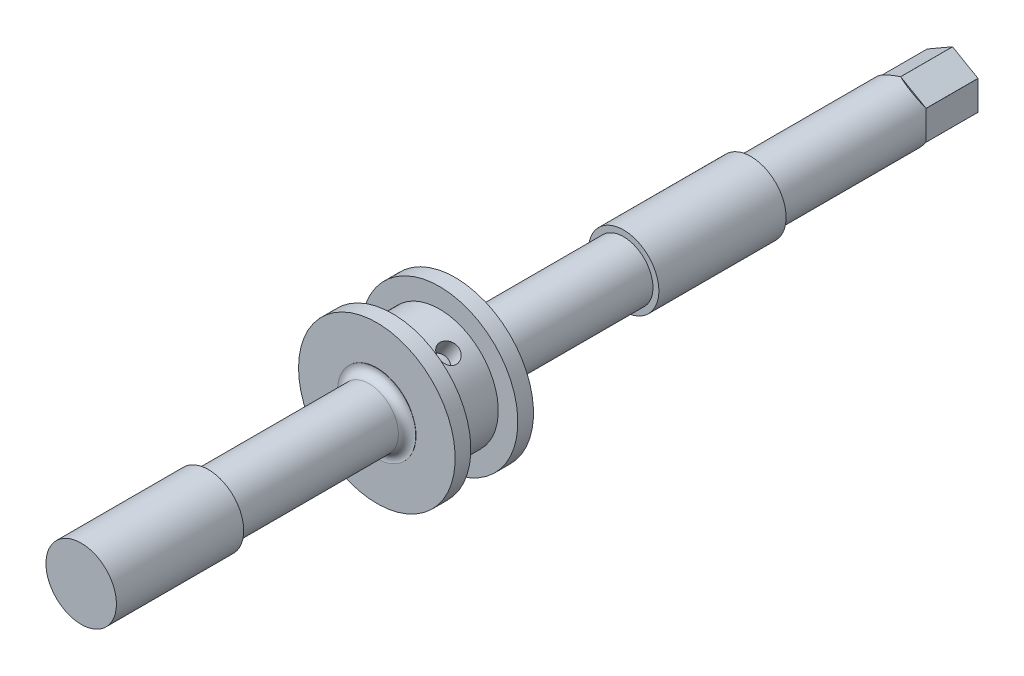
ISO-10303-21;
HEADER;
FILE_DESCRIPTION(('STEP AP214'),'2;1');
FILE_NAME('part.step','',(''),(''),'','','');
FILE_SCHEMA(('AUTOMOTIVE_DESIGN { 1 0 10303 214 1 1 1 1 }'));
ENDSEC;
DATA;
#1=APPLICATION_CONTEXT('core data for automotive mechanical design processes');
#2=APPLICATION_PROTOCOL_DEFINITION('international standard','automotive_design',2000,#1);
#3=PRODUCT_CONTEXT('',#1,'mechanical');
#4=PRODUCT('Part','Part','',(#3));
#5=PRODUCT_RELATED_PRODUCT_CATEGORY('part','',(#4));
#6=PRODUCT_DEFINITION_FORMATION('','',#4);
#7=PRODUCT_DEFINITION_CONTEXT('part definition',#1,'design');
#8=PRODUCT_DEFINITION('design','',#6,#7);
#9=PRODUCT_DEFINITION_SHAPE('','',#8);
#10=(LENGTH_UNIT() NAMED_UNIT(*) SI_UNIT(.MILLI.,.METRE.));
#11=(NAMED_UNIT(*) PLANE_ANGLE_UNIT() SI_UNIT($,.RADIAN.));
#12=(NAMED_UNIT(*) SI_UNIT($,.STERADIAN.) SOLID_ANGLE_UNIT());
#13=UNCERTAINTY_MEASURE_WITH_UNIT(LENGTH_MEASURE(1.E-05),#10,'distance_accuracy_value','');
#14=(GEOMETRIC_REPRESENTATION_CONTEXT(3) GLOBAL_UNCERTAINTY_ASSIGNED_CONTEXT((#13)) GLOBAL_UNIT_ASSIGNED_CONTEXT((#10,
#11,#12)) REPRESENTATION_CONTEXT('',''));
#15=CARTESIAN_POINT('',(0.,0.,0.));
#16=DIRECTION('',(0.,0.,1.));
#17=DIRECTION('',(1.,0.,0.));
#18=AXIS2_PLACEMENT_3D('',#15,#16,#17);
#19=CARTESIAN_POINT('',(0.,0.,-137.));
#20=DIRECTION('',(0.,0.,-1.));
#21=DIRECTION('',(-1.,0.,0.));
#22=AXIS2_PLACEMENT_3D('',#19,#20,#21);
#23=PLANE('',#22);
#24=CARTESIAN_POINT('',(0.,0.,-137.));
#25=DIRECTION('',(0.,0.,-1.));
#26=DIRECTION('',(-1.,0.,0.));
#27=AXIS2_PLACEMENT_3D('',#24,#25,#26);
#28=CIRCLE('',#27,7.5);
#29=CARTESIAN_POINT('',(0.0096296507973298,-7.49999381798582,-137.));
#30=VERTEX_POINT('',#29);
#31=CARTESIAN_POINT('',(-0.0096296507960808,-7.49999381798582,-137.));
#32=VERTEX_POINT('',#31);
#33=EDGE_CURVE('E159',#30,#32,#28,.T.);
#34=ORIENTED_EDGE('',*,*,#33,.T.);
#35=DIRECTION('',(-0.866025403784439,0.5,0.));
#36=VECTOR('',#35,1.);
#37=CARTESIAN_POINT('',(-3.25,-5.62916512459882,-137.));
#38=LINE('',#37,#36);
#39=CARTESIAN_POINT('',(-6.49037034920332,-3.75833643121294,-137.));
#40=VERTEX_POINT('',#39);
#41=EDGE_CURVE('E22',#32,#40,#38,.T.);
#42=ORIENTED_EDGE('',*,*,#41,.T.);
#43=CARTESIAN_POINT('',(-6.5,-3.74165738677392,-137.));
#44=VERTEX_POINT('',#43);
#45=EDGE_CURVE('E156',#40,#44,#28,.T.);
#46=ORIENTED_EDGE('',*,*,#45,.T.);
#47=DIRECTION('',(0.,1.,0.));
#48=VECTOR('',#47,1.);
#49=CARTESIAN_POINT('',(-6.5,0.,-137.));
#50=LINE('',#49,#48);
#51=CARTESIAN_POINT('',(-6.50000000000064,3.74165738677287,-137.));
#52=VERTEX_POINT('',#51);
#53=EDGE_CURVE('E160',#44,#52,#50,.T.);
#54=ORIENTED_EDGE('',*,*,#53,.T.);
#55=CARTESIAN_POINT('',(-6.49037034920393,3.7583364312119,-137.));
#56=VERTEX_POINT('',#55);
#57=EDGE_CURVE('E42',#52,#56,#28,.T.);
#58=ORIENTED_EDGE('',*,*,#57,.T.);
#59=DIRECTION('',(0.866025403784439,0.5,0.));
#60=VECTOR('',#59,1.);
#61=CARTESIAN_POINT('',(-3.25,5.62916512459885,-137.));
#62=LINE('',#61,#60);
#63=CARTESIAN_POINT('',(-0.00962965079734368,7.49999381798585,-137.));
#64=VERTEX_POINT('',#63);
#65=EDGE_CURVE('E35',#56,#64,#62,.T.);
#66=ORIENTED_EDGE('',*,*,#65,.T.);
#67=CARTESIAN_POINT('',(0.00962965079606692,7.49999381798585,-137.));
#68=VERTEX_POINT('',#67);
#69=EDGE_CURVE('E177',#64,#68,#28,.T.);
#70=ORIENTED_EDGE('',*,*,#69,.T.);
#71=DIRECTION('',(0.866025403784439,-0.5,0.));
#72=VECTOR('',#71,1.);
#73=CARTESIAN_POINT('',(3.25,5.62916512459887,-137.));
#74=LINE('',#73,#72);
#75=CARTESIAN_POINT('',(6.49037034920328,3.75833643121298,-137.));
#76=VERTEX_POINT('',#75);
#77=EDGE_CURVE('E163',#68,#76,#74,.T.);
#78=ORIENTED_EDGE('',*,*,#77,.T.);
#79=CARTESIAN_POINT('',(6.5,3.74165738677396,-137.));
#80=VERTEX_POINT('',#79);
#81=EDGE_CURVE('E175',#76,#80,#28,.T.);
#82=ORIENTED_EDGE('',*,*,#81,.T.);
#83=DIRECTION('',(0.,-1.,0.));
#84=VECTOR('',#83,1.);
#85=CARTESIAN_POINT('',(6.5,0.,-137.));
#86=LINE('',#85,#84);
#87=CARTESIAN_POINT('',(6.50000000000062,-3.74165738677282,-137.));
#88=VERTEX_POINT('',#87);
#89=EDGE_CURVE('E166',#80,#88,#86,.T.);
#90=ORIENTED_EDGE('',*,*,#89,.T.);
#91=CARTESIAN_POINT('',(6.49037034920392,-3.75833643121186,-137.));
#92=VERTEX_POINT('',#91);
#93=EDGE_CURVE('E174',#88,#92,#28,.T.);
#94=ORIENTED_EDGE('',*,*,#93,.T.);
#95=DIRECTION('',(-0.866025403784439,-0.5,0.));
#96=VECTOR('',#95,1.);
#97=CARTESIAN_POINT('',(3.25,-5.62916512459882,-137.));
#98=LINE('',#97,#96);
#99=EDGE_CURVE('E168',#92,#30,#98,.T.);
#100=ORIENTED_EDGE('',*,*,#99,.T.);
#101=EDGE_LOOP('',(#34,#42,#46,#54,#58,#66,#70,#78,#82,#90,#94,#100));
#102=FACE_BOUND('',#101,.T.);
#103=ADVANCED_FACE('F18',(#102),#23,.T.);
#104=CARTESIAN_POINT('',(0.,0.,-85.5));
#105=DIRECTION('',(0.,0.,-1.));
#106=DIRECTION('',(-1.,0.,0.));
#107=AXIS2_PLACEMENT_3D('',#104,#105,#106);
#108=PLANE('',#107);
#109=CARTESIAN_POINT('',(0.,0.,-85.5));
#110=DIRECTION('',(0.,0.,-1.));
#111=DIRECTION('',(-1.,0.,0.));
#112=AXIS2_PLACEMENT_3D('',#109,#110,#111);
#113=CIRCLE('',#112,7.5);
#114=CARTESIAN_POINT('',(-7.50000000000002,0.,-85.5));
#115=VERTEX_POINT('',#114);
#116=EDGE_CURVE('E240',#115,#115,#113,.F.);
#117=ORIENTED_EDGE('',*,*,#116,.T.);
#118=EDGE_LOOP('',(#117));
#119=FACE_BOUND('',#118,.T.);
#120=CARTESIAN_POINT('',(0.,0.,-85.5));
#121=DIRECTION('',(0.,0.,-1.));
#122=DIRECTION('',(-1.,0.,0.));
#123=AXIS2_PLACEMENT_3D('',#120,#121,#122);
#124=CIRCLE('',#123,9.);
#125=CARTESIAN_POINT('',(-9.00000000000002,0.,-85.5));
#126=VERTEX_POINT('',#125);
#127=EDGE_CURVE('E150',#126,#126,#124,.T.);
#128=ORIENTED_EDGE('',*,*,#127,.T.);
#129=EDGE_LOOP('',(#128));
#130=FACE_BOUND('',#129,.T.);
#131=ADVANCED_FACE('F266',(#119,#130),#108,.T.);
#132=CARTESIAN_POINT('',(6.5,-3.75277674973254,-123.75));
#133=DIRECTION('',(0.353553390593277,-0.612372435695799,-0.707106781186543));
#134=DIRECTION('',(0.,0.75592894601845,-0.654653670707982));
#135=AXIS2_PLACEMENT_3D('',#132,#133,#134);
#136=PLANE('',#135);
#137=DIRECTION('',(0.866025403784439,0.5,0.));
#138=VECTOR('',#137,1.);
#139=CARTESIAN_POINT('',(6.5,-3.75277674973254,-123.75));
#140=LINE('',#139,#138);
#141=CARTESIAN_POINT('',(6.49037034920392,-3.75833643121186,-123.75));
#142=VERTEX_POINT('',#141);
#143=CARTESIAN_POINT('',(0.0096296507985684,-7.4999938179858,-123.749999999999));
#144=VERTEX_POINT('',#143);
#145=EDGE_CURVE('E118',#142,#144,#140,.F.);
#146=ORIENTED_EDGE('',*,*,#145,.F.);
#147=CARTESIAN_POINT('',(0.,0.,-130.25));
#148=DIRECTION('',(0.353553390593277,-0.612372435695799,-0.707106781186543));
#149=DIRECTION('',(-0.353553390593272,0.61237243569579,-0.707106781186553));
#150=AXIS2_PLACEMENT_3D('',#147,#148,#149);
#151=ELLIPSE('',#150,10.6066017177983,7.5);
#152=EDGE_CURVE('E135',#144,#142,#151,.F.);
#153=ORIENTED_EDGE('',*,*,#152,.F.);
#154=EDGE_LOOP('',(#146,#153));
#155=FACE_BOUND('',#154,.T.);
#156=ADVANCED_FACE('F272',(#155),#136,.T.);
#157=CARTESIAN_POINT('',(6.5,-3.75277674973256,-122.25));
#158=DIRECTION('',(0.5,-0.866025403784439,0.));
#159=DIRECTION('',(0.866025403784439,0.5,0.));
#160=AXIS2_PLACEMENT_3D('',#157,#158,#159);
#161=PLANE('',#160);
#162=ORIENTED_EDGE('',*,*,#99,.F.);
#163=DIRECTION('',(0.,0.,-1.));
#164=VECTOR('',#163,1.);
#165=CARTESIAN_POINT('',(6.49037034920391,-3.75833643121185,-85.5));
#166=LINE('',#165,#164);
#167=EDGE_CURVE('E206',#142,#92,#166,.T.);
#168=ORIENTED_EDGE('',*,*,#167,.F.);
#169=ORIENTED_EDGE('',*,*,#145,.T.);
#170=DIRECTION('',(0.,0.,-1.));
#171=VECTOR('',#170,1.);
#172=CARTESIAN_POINT('',(0.00962965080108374,-7.49999381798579,-85.5));
#173=LINE('',#172,#171);
#174=EDGE_CURVE('E126',#30,#144,#173,.F.);
#175=ORIENTED_EDGE('',*,*,#174,.F.);
#176=EDGE_LOOP('',(#162,#168,#169,#175));
#177=FACE_BOUND('',#176,.T.);
#178=ADVANCED_FACE('F312',(#177),#161,.T.);
#179=CARTESIAN_POINT('',(0.,-7.50555349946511,-123.75));
#180=DIRECTION('',(-0.353553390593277,-0.612372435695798,-0.707106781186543));
#181=DIRECTION('',(0.,0.75592894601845,-0.654653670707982));
#182=AXIS2_PLACEMENT_3D('',#179,#180,#181);
#183=PLANE('',#182);
#184=DIRECTION('',(0.866025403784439,-0.5,0.));
#185=VECTOR('',#184,1.);
#186=CARTESIAN_POINT('',(0.,-7.50555349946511,-123.75));
#187=LINE('',#186,#185);
#188=CARTESIAN_POINT('',(-0.0096296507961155,-7.49999381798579,-123.75));
#189=VERTEX_POINT('',#188);
#190=CARTESIAN_POINT('',(-6.49037034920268,-3.75833643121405,-123.749999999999));
#191=VERTEX_POINT('',#190);
#192=EDGE_CURVE('E111',#189,#191,#187,.F.);
#193=ORIENTED_EDGE('',*,*,#192,.F.);
#194=CARTESIAN_POINT('',(0.,0.,-130.25));
#195=DIRECTION('',(-0.353553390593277,-0.612372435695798,-0.707106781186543));
#196=DIRECTION('',(0.353553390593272,0.612372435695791,-0.707106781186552));
#197=AXIS2_PLACEMENT_3D('',#194,#195,#196);
#198=ELLIPSE('',#197,10.6066017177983,7.5);
#199=EDGE_CURVE('E115',#191,#189,#198,.F.);
#200=ORIENTED_EDGE('',*,*,#199,.F.);
#201=EDGE_LOOP('',(#193,#200));
#202=FACE_BOUND('',#201,.T.);
#203=ADVANCED_FACE('F113',(#202),#183,.T.);
#204=CARTESIAN_POINT('',(0.,-7.50555349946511,-122.25));
#205=DIRECTION('',(-0.5,-0.866025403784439,0.));
#206=DIRECTION('',(0.866025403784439,-0.5,0.));
#207=AXIS2_PLACEMENT_3D('',#204,#205,#206);
#208=PLANE('',#207);
#209=ORIENTED_EDGE('',*,*,#41,.F.);
#210=DIRECTION('',(0.,0.,-1.));
#211=VECTOR('',#210,1.);
#212=CARTESIAN_POINT('',(-0.0096296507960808,-7.49999381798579,-85.5));
#213=LINE('',#212,#211);
#214=EDGE_CURVE('E122',#189,#32,#213,.T.);
#215=ORIENTED_EDGE('',*,*,#214,.F.);
#216=ORIENTED_EDGE('',*,*,#192,.T.);
#217=DIRECTION('',(0.,0.,-1.));
#218=VECTOR('',#217,1.);
#219=CARTESIAN_POINT('',(-6.49037034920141,-3.75833643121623,-85.5));
#220=LINE('',#219,#218);
#221=EDGE_CURVE('E129',#40,#191,#220,.F.);
#222=ORIENTED_EDGE('',*,*,#221,.F.);
#223=EDGE_LOOP('',(#209,#215,#216,#222));
#224=FACE_BOUND('',#223,.T.);
#225=ADVANCED_FACE('F123',(#224),#208,.T.);
#226=CARTESIAN_POINT('',(-6.5,-3.75277674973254,-123.75));
#227=DIRECTION('',(-0.707106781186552,0.,-0.707106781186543));
#228=DIRECTION('',(-0.707106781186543,0.,0.707106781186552));
#229=AXIS2_PLACEMENT_3D('',#226,#227,#228);
#230=PLANE('',#229);
#231=DIRECTION('',(0.,1.,0.));
#232=VECTOR('',#231,1.);
#233=CARTESIAN_POINT('',(-6.5,-3.75277674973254,-123.75));
#234=LINE('',#233,#232);
#235=CARTESIAN_POINT('',(-6.50000000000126,3.74165738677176,-123.749999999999));
#236=VERTEX_POINT('',#235);
#237=CARTESIAN_POINT('',(-6.5,-3.74165738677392,-123.75));
#238=VERTEX_POINT('',#237);
#239=EDGE_CURVE('E211',#236,#238,#234,.F.);
#240=ORIENTED_EDGE('',*,*,#239,.T.);
#241=CARTESIAN_POINT('',(0.,0.,-130.25));
#242=DIRECTION('',(-0.707106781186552,0.,-0.707106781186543));
#243=DIRECTION('',(0.707106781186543,0.,-0.707106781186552));
#244=AXIS2_PLACEMENT_3D('',#241,#242,#243);
#245=ELLIPSE('',#244,10.6066017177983,7.5);
#246=EDGE_CURVE('E189',#236,#238,#245,.F.);
#247=ORIENTED_EDGE('',*,*,#246,.F.);
#248=EDGE_LOOP('',(#240,#247));
#249=FACE_BOUND('',#248,.T.);
#250=ADVANCED_FACE('F281',(#249),#230,.T.);
#251=CARTESIAN_POINT('',(-6.5,-3.75277674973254,-122.25));
#252=DIRECTION('',(-1.,0.,0.));
#253=DIRECTION('',(0.,0.,1.));
#254=AXIS2_PLACEMENT_3D('',#251,#252,#253);
#255=PLANE('',#254);
#256=ORIENTED_EDGE('',*,*,#53,.F.);
#257=DIRECTION('',(0.,0.,-1.));
#258=VECTOR('',#257,1.);
#259=CARTESIAN_POINT('',(-6.5,-3.74165738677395,-85.5));
#260=LINE('',#259,#258);
#261=EDGE_CURVE('E131',#238,#44,#260,.T.);
#262=ORIENTED_EDGE('',*,*,#261,.F.);
#263=ORIENTED_EDGE('',*,*,#239,.F.);
#264=DIRECTION('',(0.,0.,-1.));
#265=VECTOR('',#264,1.);
#266=CARTESIAN_POINT('',(-6.50000000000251,3.74165738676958,-85.5));
#267=LINE('',#266,#265);
#268=EDGE_CURVE('E187',#52,#236,#267,.F.);
#269=ORIENTED_EDGE('',*,*,#268,.F.);
#270=EDGE_LOOP('',(#256,#262,#263,#269));
#271=FACE_BOUND('',#270,.T.);
#272=ADVANCED_FACE('F282',(#271),#255,.T.);
#273=CARTESIAN_POINT('',(-6.5,3.75277674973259,-123.75));
#274=DIRECTION('',(-0.353553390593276,0.612372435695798,-0.707106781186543));
#275=DIRECTION('',(0.,0.75592894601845,0.654653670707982));
#276=AXIS2_PLACEMENT_3D('',#273,#274,#275);
#277=PLANE('',#276);
#278=DIRECTION('',(-0.866025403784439,-0.5,0.));
#279=VECTOR('',#278,1.);
#280=CARTESIAN_POINT('',(-6.5,3.75277674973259,-123.75));
#281=LINE('',#280,#279);
#282=CARTESIAN_POINT('',(-6.49037034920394,3.75833643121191,-123.75));
#283=VERTEX_POINT('',#282);
#284=CARTESIAN_POINT('',(-0.00962965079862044,7.49999381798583,-123.75));
#285=VERTEX_POINT('',#284);
#286=EDGE_CURVE('E214',#283,#285,#281,.F.);
#287=ORIENTED_EDGE('',*,*,#286,.F.);
#288=CARTESIAN_POINT('',(0.,0.,-130.25));
#289=DIRECTION('',(-0.353553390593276,0.612372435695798,-0.707106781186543));
#290=DIRECTION('',(0.353553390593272,-0.612372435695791,-0.707106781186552));
#291=AXIS2_PLACEMENT_3D('',#288,#289,#290);
#292=ELLIPSE('',#291,10.6066017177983,7.5);
#293=EDGE_CURVE('E185',#285,#283,#292,.F.);
#294=ORIENTED_EDGE('',*,*,#293,.F.);
#295=EDGE_LOOP('',(#287,#294));
#296=FACE_BOUND('',#295,.T.);
#297=ADVANCED_FACE('F285',(#296),#277,.T.);
#298=CARTESIAN_POINT('',(-6.5,3.7527767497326,-122.25));
#299=DIRECTION('',(-0.5,0.866025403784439,0.));
#300=DIRECTION('',(-0.866025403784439,-0.5,0.));
#301=AXIS2_PLACEMENT_3D('',#298,#299,#300);
#302=PLANE('',#301);
#303=ORIENTED_EDGE('',*,*,#65,.F.);
#304=DIRECTION('',(0.,0.,-1.));
#305=VECTOR('',#304,1.);
#306=CARTESIAN_POINT('',(-6.49037034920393,3.75833643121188,-85.5));
#307=LINE('',#306,#305);
#308=EDGE_CURVE('E183',#283,#56,#307,.T.);
#309=ORIENTED_EDGE('',*,*,#308,.F.);
#310=ORIENTED_EDGE('',*,*,#286,.T.);
#311=DIRECTION('',(0.,0.,-1.));
#312=VECTOR('',#311,1.);
#313=CARTESIAN_POINT('',(-0.00962965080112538,7.49999381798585,-85.5));
#314=LINE('',#313,#312);
#315=EDGE_CURVE('E191',#64,#285,#314,.F.);
#316=ORIENTED_EDGE('',*,*,#315,.F.);
#317=EDGE_LOOP('',(#303,#309,#310,#316));
#318=FACE_BOUND('',#317,.T.);
#319=ADVANCED_FACE('F287',(#318),#302,.T.);
#320=CARTESIAN_POINT('',(0.,7.50555349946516,-123.75));
#321=DIRECTION('',(0.353553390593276,0.612372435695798,-0.707106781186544));
#322=DIRECTION('',(0.,0.755928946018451,0.654653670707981));
#323=AXIS2_PLACEMENT_3D('',#320,#321,#322);
#324=PLANE('',#323);
#325=DIRECTION('',(-0.866025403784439,0.5,0.));
#326=VECTOR('',#325,1.);
#327=CARTESIAN_POINT('',(0.,7.50555349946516,-123.75));
#328=LINE('',#327,#326);
#329=CARTESIAN_POINT('',(0.00962965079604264,7.49999381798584,-123.75));
#330=VERTEX_POINT('',#329);
#331=CARTESIAN_POINT('',(6.49037034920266,3.75833643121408,-123.75));
#332=VERTEX_POINT('',#331);
#333=EDGE_CURVE('E216',#330,#332,#328,.F.);
#334=ORIENTED_EDGE('',*,*,#333,.F.);
#335=CARTESIAN_POINT('',(0.,0.,-130.25));
#336=DIRECTION('',(0.353553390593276,0.612372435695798,-0.707106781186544));
#337=DIRECTION('',(-0.353553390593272,-0.612372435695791,-0.707106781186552));
#338=AXIS2_PLACEMENT_3D('',#335,#336,#337);
#339=ELLIPSE('',#338,10.6066017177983,7.5);
#340=EDGE_CURVE('E198',#332,#330,#339,.F.);
#341=ORIENTED_EDGE('',*,*,#340,.F.);
#342=EDGE_LOOP('',(#334,#341));
#343=FACE_BOUND('',#342,.T.);
#344=ADVANCED_FACE('F289',(#343),#324,.T.);
#345=CARTESIAN_POINT('',(0.,7.50555349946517,-122.25));
#346=DIRECTION('',(0.5,0.866025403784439,0.));
#347=DIRECTION('',(-0.866025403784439,0.5,0.));
#348=AXIS2_PLACEMENT_3D('',#345,#346,#347);
#349=PLANE('',#348);
#350=ORIENTED_EDGE('',*,*,#77,.F.);
#351=DIRECTION('',(0.,0.,-1.));
#352=VECTOR('',#351,1.);
#353=CARTESIAN_POINT('',(0.00962965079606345,7.49999381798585,-85.5));
#354=LINE('',#353,#352);
#355=EDGE_CURVE('E196',#330,#68,#354,.T.);
#356=ORIENTED_EDGE('',*,*,#355,.F.);
#357=ORIENTED_EDGE('',*,*,#333,.T.);
#358=DIRECTION('',(0.,0.,-1.));
#359=VECTOR('',#358,1.);
#360=CARTESIAN_POINT('',(6.49037034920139,3.75833643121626,-85.5));
#361=LINE('',#360,#359);
#362=EDGE_CURVE('E199',#76,#332,#361,.F.);
#363=ORIENTED_EDGE('',*,*,#362,.F.);
#364=EDGE_LOOP('',(#350,#356,#357,#363));
#365=FACE_BOUND('',#364,.T.);
#366=ADVANCED_FACE('F262',(#365),#349,.T.);
#367=CARTESIAN_POINT('',(6.5,3.7527767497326,-123.75));
#368=DIRECTION('',(0.707106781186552,0.,-0.707106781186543));
#369=DIRECTION('',(-0.707106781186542,0.,-0.707106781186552));
#370=AXIS2_PLACEMENT_3D('',#367,#368,#369);
#371=PLANE('',#370);
#372=CARTESIAN_POINT('',(0.,0.,-130.25));
#373=DIRECTION('',(0.707106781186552,0.,-0.707106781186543));
#374=DIRECTION('',(-0.707106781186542,0.,-0.707106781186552));
#375=AXIS2_PLACEMENT_3D('',#372,#373,#374);
#376=ELLIPSE('',#375,10.6066017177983,7.5);
#377=CARTESIAN_POINT('',(6.50000000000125,-3.74165738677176,-123.749999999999));
#378=VERTEX_POINT('',#377);
#379=CARTESIAN_POINT('',(6.5,3.74165738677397,-123.75));
#380=VERTEX_POINT('',#379);
#381=EDGE_CURVE('E203',#378,#380,#376,.F.);
#382=ORIENTED_EDGE('',*,*,#381,.F.);
#383=DIRECTION('',(0.,1.,0.));
#384=VECTOR('',#383,1.);
#385=CARTESIAN_POINT('',(6.5,3.7527767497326,-123.75));
#386=LINE('',#385,#384);
#387=EDGE_CURVE('E219',#380,#378,#386,.F.);
#388=ORIENTED_EDGE('',*,*,#387,.F.);
#389=EDGE_LOOP('',(#382,#388));
#390=FACE_BOUND('',#389,.T.);
#391=ADVANCED_FACE('F250',(#390),#371,.T.);
#392=CARTESIAN_POINT('',(6.5,3.7527767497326,-122.25));
#393=DIRECTION('',(1.,0.,0.));
#394=DIRECTION('',(0.,0.,-1.));
#395=AXIS2_PLACEMENT_3D('',#392,#393,#394);
#396=PLANE('',#395);
#397=ORIENTED_EDGE('',*,*,#89,.F.);
#398=DIRECTION('',(0.,0.,-1.));
#399=VECTOR('',#398,1.);
#400=CARTESIAN_POINT('',(6.5,3.74165738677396,-85.5));
#401=LINE('',#400,#399);
#402=EDGE_CURVE('E201',#380,#80,#401,.T.);
#403=ORIENTED_EDGE('',*,*,#402,.F.);
#404=ORIENTED_EDGE('',*,*,#387,.T.);
#405=DIRECTION('',(0.,0.,-1.));
#406=VECTOR('',#405,1.);
#407=CARTESIAN_POINT('',(6.5000000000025,-3.74165738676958,-85.5));
#408=LINE('',#407,#406);
#409=EDGE_CURVE('E204',#88,#378,#408,.F.);
#410=ORIENTED_EDGE('',*,*,#409,.F.);
#411=EDGE_LOOP('',(#397,#403,#404,#410));
#412=FACE_BOUND('',#411,.T.);
#413=ADVANCED_FACE('F252',(#412),#396,.T.);
#414=CARTESIAN_POINT('',(0.,0.,-85.5));
#415=DIRECTION('',(0.,0.,-1.));
#416=DIRECTION('',(-1.,0.,0.));
#417=AXIS2_PLACEMENT_3D('',#414,#415,#416);
#418=CYLINDRICAL_SURFACE('',#417,7.5);
#419=ORIENTED_EDGE('',*,*,#57,.F.);
#420=ORIENTED_EDGE('',*,*,#268,.T.);
#421=ORIENTED_EDGE('',*,*,#246,.T.);
#422=ORIENTED_EDGE('',*,*,#261,.T.);
#423=ORIENTED_EDGE('',*,*,#45,.F.);
#424=ORIENTED_EDGE('',*,*,#221,.T.);
#425=ORIENTED_EDGE('',*,*,#199,.T.);
#426=ORIENTED_EDGE('',*,*,#214,.T.);
#427=ORIENTED_EDGE('',*,*,#33,.F.);
#428=ORIENTED_EDGE('',*,*,#174,.T.);
#429=ORIENTED_EDGE('',*,*,#152,.T.);
#430=ORIENTED_EDGE('',*,*,#167,.T.);
#431=ORIENTED_EDGE('',*,*,#93,.F.);
#432=ORIENTED_EDGE('',*,*,#409,.T.);
#433=ORIENTED_EDGE('',*,*,#381,.T.);
#434=ORIENTED_EDGE('',*,*,#402,.T.);
#435=ORIENTED_EDGE('',*,*,#81,.F.);
#436=ORIENTED_EDGE('',*,*,#362,.T.);
#437=ORIENTED_EDGE('',*,*,#340,.T.);
#438=ORIENTED_EDGE('',*,*,#355,.T.);
#439=ORIENTED_EDGE('',*,*,#69,.F.);
#440=ORIENTED_EDGE('',*,*,#315,.T.);
#441=ORIENTED_EDGE('',*,*,#293,.T.);
#442=ORIENTED_EDGE('',*,*,#308,.T.);
#443=EDGE_LOOP('',(#419,#420,#421,#422,#423,#424,#425,#426,#427,#428,#429,#430,#431,#432,#433,
#434,#435,#436,#437,#438,#439,#440,#441,#442));
#444=FACE_BOUND('',#443,.T.);
#445=ORIENTED_EDGE('',*,*,#116,.F.);
#446=EDGE_LOOP('',(#445));
#447=FACE_BOUND('',#446,.T.);
#448=ADVANCED_FACE('F20',(#444,#447),#418,.T.);
#449=CARTESIAN_POINT('',(0.,0.,-12.));
#450=DIRECTION('',(0.,0.,1.));
#451=DIRECTION('',(1.,0.,0.));
#452=AXIS2_PLACEMENT_3D('',#449,#450,#451);
#453=TOROIDAL_SURFACE('',#452,9.5,2.);
#454=CARTESIAN_POINT('',(0.,0.,-12.));
#455=DIRECTION('',(0.,0.,-1.));
#456=DIRECTION('',(-1.,0.,0.));
#457=AXIS2_PLACEMENT_3D('',#454,#455,#456);
#458=CIRCLE('',#457,7.5);
#459=CARTESIAN_POINT('',(-7.50000000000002,0.,-12.));
#460=VERTEX_POINT('',#459);
#461=EDGE_CURVE('E236',#460,#460,#458,.T.);
#462=ORIENTED_EDGE('',*,*,#461,.F.);
#463=EDGE_LOOP('',(#462));
#464=FACE_BOUND('',#463,.T.);
#465=CARTESIAN_POINT('',(0.,0.,-10.));
#466=DIRECTION('',(0.,0.,1.));
#467=DIRECTION('',(1.,0.,0.));
#468=AXIS2_PLACEMENT_3D('',#465,#466,#467);
#469=CIRCLE('',#468,9.5);
#470=CARTESIAN_POINT('',(9.49999999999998,0.,-10.));
#471=VERTEX_POINT('',#470);
#472=EDGE_CURVE('E233',#471,#471,#469,.F.);
#473=ORIENTED_EDGE('',*,*,#472,.T.);
#474=EDGE_LOOP('',(#473));
#475=FACE_BOUND('',#474,.T.);
#476=ADVANCED_FACE('F261',(#464,#475),#453,.F.);
#477=CARTESIAN_POINT('',(0.,0.,-10.));
#478=DIRECTION('',(0.,0.,1.));
#479=DIRECTION('',(1.,0.,0.));
#480=AXIS2_PLACEMENT_3D('',#477,#478,#479);
#481=PLANE('',#480);
#482=ORIENTED_EDGE('',*,*,#472,.F.);
#483=EDGE_LOOP('',(#482));
#484=FACE_BOUND('',#483,.T.);
#485=CARTESIAN_POINT('',(0.,0.,-10.));
#486=DIRECTION('',(0.,0.,1.));
#487=DIRECTION('',(0.997927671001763,-0.0643456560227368,0.));
#488=AXIS2_PLACEMENT_3D('',#485,#486,#487);
#489=CIRCLE('',#488,20.);
#490=CARTESIAN_POINT('',(19.9585534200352,-1.2869131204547,-9.99999999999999));
#491=VERTEX_POINT('',#490);
#492=EDGE_CURVE('E483',#491,#491,#489,.F.);
#493=ORIENTED_EDGE('',*,*,#492,.T.);
#494=EDGE_LOOP('',(#493));
#495=FACE_BOUND('',#494,.T.);
#496=ADVANCED_FACE('F318',(#484,#495),#481,.F.);
#497=CARTESIAN_POINT('',(0.,0.,-53.));
#498=DIRECTION('',(0.,0.,1.));
#499=DIRECTION('',(1.,0.,0.));
#500=AXIS2_PLACEMENT_3D('',#497,#498,#499);
#501=CYLINDRICAL_SURFACE('',#500,7.5);
#502=CARTESIAN_POINT('',(0.,0.,-53.));
#503=DIRECTION('',(0.,0.,1.));
#504=DIRECTION('',(1.,0.,0.));
#505=AXIS2_PLACEMENT_3D('',#502,#503,#504);
#506=CIRCLE('',#505,7.5);
#507=CARTESIAN_POINT('',(7.5,0.,-53.));
#508=VERTEX_POINT('',#507);
#509=EDGE_CURVE('E237',#508,#508,#506,.T.);
#510=ORIENTED_EDGE('',*,*,#509,.T.);
#511=EDGE_LOOP('',(#510));
#512=FACE_BOUND('',#511,.T.);
#513=ORIENTED_EDGE('',*,*,#461,.T.);
#514=EDGE_LOOP('',(#513));
#515=FACE_BOUND('',#514,.T.);
#516=ADVANCED_FACE('F329',(#512,#515),#501,.T.);
#517=CARTESIAN_POINT('',(0.,0.,-53.));
#518=DIRECTION('',(0.,0.,-1.));
#519=DIRECTION('',(-1.,0.,0.));
#520=AXIS2_PLACEMENT_3D('',#517,#518,#519);
#521=PLANE('',#520);
#522=CARTESIAN_POINT('',(0.,0.,-53.));
#523=DIRECTION('',(0.,0.,-1.));
#524=DIRECTION('',(-1.,0.,0.));
#525=AXIS2_PLACEMENT_3D('',#522,#523,#524);
#526=CIRCLE('',#525,9.);
#527=CARTESIAN_POINT('',(-9.,0.,-53.));
#528=VERTEX_POINT('',#527);
#529=EDGE_CURVE('E147',#528,#528,#526,.T.);
#530=ORIENTED_EDGE('',*,*,#529,.F.);
#531=EDGE_LOOP('',(#530));
#532=FACE_BOUND('',#531,.T.);
#533=ORIENTED_EDGE('',*,*,#509,.F.);
#534=EDGE_LOOP('',(#533));
#535=FACE_BOUND('',#534,.T.);
#536=ADVANCED_FACE('F356',(#532,#535),#521,.F.);
#537=CARTESIAN_POINT('',(0.,0.,122.));
#538=DIRECTION('',(0.,0.,-1.));
#539=DIRECTION('',(-1.,0.,0.));
#540=AXIS2_PLACEMENT_3D('',#537,#538,#539);
#541=CYLINDRICAL_SURFACE('',#540,9.);
#542=ORIENTED_EDGE('',*,*,#127,.F.);
#543=EDGE_LOOP('',(#542));
#544=FACE_BOUND('',#543,.T.);
#545=ORIENTED_EDGE('',*,*,#529,.T.);
#546=EDGE_LOOP('',(#545));
#547=FACE_BOUND('',#546,.T.);
#548=ADVANCED_FACE('F358',(#544,#547),#541,.T.);
#549=CARTESIAN_POINT('',(0.,0.,10.));
#550=DIRECTION('',(0.,0.,-1.));
#551=DIRECTION('',(-0.997927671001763,0.0643456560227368,0.));
#552=AXIS2_PLACEMENT_3D('',#549,#550,#551);
#553=CYLINDRICAL_SURFACE('',#552,20.);
#554=CARTESIAN_POINT('',(0.,0.,6.));
#555=DIRECTION('',(0.,0.,1.));
#556=DIRECTION('',(0.997927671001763,-0.0643456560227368,0.));
#557=AXIS2_PLACEMENT_3D('',#554,#555,#556);
#558=CIRCLE('',#557,20.);
#559=CARTESIAN_POINT('',(19.9585534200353,-1.28691312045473,6.00000000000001));
#560=VERTEX_POINT('',#559);
#561=EDGE_CURVE('E488',#560,#560,#558,.F.);
#562=ORIENTED_EDGE('',*,*,#561,.F.);
#563=EDGE_LOOP('',(#562));
#564=FACE_BOUND('',#563,.T.);
#565=CARTESIAN_POINT('',(0.,0.,10.));
#566=DIRECTION('',(0.,0.,1.));
#567=DIRECTION('',(0.997927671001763,-0.0643456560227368,0.));
#568=AXIS2_PLACEMENT_3D('',#565,#566,#567);
#569=CIRCLE('',#568,20.);
#570=CARTESIAN_POINT('',(19.9585534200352,-1.28691312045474,10.));
#571=VERTEX_POINT('',#570);
#572=EDGE_CURVE('E490',#571,#571,#569,.F.);
#573=ORIENTED_EDGE('',*,*,#572,.T.);
#574=EDGE_LOOP('',(#573));
#575=FACE_BOUND('',#574,.T.);
#576=ADVANCED_FACE('F362',(#564,#575),#553,.T.);
#577=CARTESIAN_POINT('',(0.,0.,6.));
#578=DIRECTION('',(0.,0.,1.));
#579=DIRECTION('',(0.997927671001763,-0.0643456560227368,0.));
#580=AXIS2_PLACEMENT_3D('',#577,#578,#579);
#581=PLANE('',#580);
#582=CARTESIAN_POINT('',(0.,0.,6.));
#583=DIRECTION('',(0.,0.,1.));
#584=DIRECTION('',(0.997927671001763,-0.0643456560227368,0.));
#585=AXIS2_PLACEMENT_3D('',#582,#583,#584);
#586=CIRCLE('',#585,15.);
#587=CARTESIAN_POINT('',(14.9689150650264,-0.965184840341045,6.00000000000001));
#588=VERTEX_POINT('',#587);
#589=EDGE_CURVE('E481',#588,#588,#586,.F.);
#590=ORIENTED_EDGE('',*,*,#589,.F.);
#591=EDGE_LOOP('',(#590));
#592=FACE_BOUND('',#591,.T.);
#593=ORIENTED_EDGE('',*,*,#561,.T.);
#594=EDGE_LOOP('',(#593));
#595=FACE_BOUND('',#594,.T.);
#596=ADVANCED_FACE('F459',(#592,#595),#581,.F.);
#597=CARTESIAN_POINT('',(0.,0.,10.));
#598=DIRECTION('',(0.,0.,-1.));
#599=DIRECTION('',(-0.997927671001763,0.0643456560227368,0.));
#600=AXIS2_PLACEMENT_3D('',#597,#598,#599);
#601=CYLINDRICAL_SURFACE('',#600,20.);
#602=ORIENTED_EDGE('',*,*,#492,.F.);
#603=EDGE_LOOP('',(#602));
#604=FACE_BOUND('',#603,.T.);
#605=CARTESIAN_POINT('',(0.,0.,-6.));
#606=DIRECTION('',(0.,0.,1.));
#607=DIRECTION('',(0.997927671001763,-0.0643456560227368,0.));
#608=AXIS2_PLACEMENT_3D('',#605,#606,#607);
#609=CIRCLE('',#608,20.);
#610=CARTESIAN_POINT('',(19.9585534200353,-1.28691312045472,-5.99999999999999));
#611=VERTEX_POINT('',#610);
#612=EDGE_CURVE('E474',#611,#611,#609,.F.);
#613=ORIENTED_EDGE('',*,*,#612,.T.);
#614=EDGE_LOOP('',(#613));
#615=FACE_BOUND('',#614,.T.);
#616=ADVANCED_FACE('F456',(#604,#615),#601,.T.);
#617=CARTESIAN_POINT('',(0.,0.,-6.));
#618=DIRECTION('',(0.,0.,1.));
#619=DIRECTION('',(0.997927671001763,-0.0643456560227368,0.));
#620=AXIS2_PLACEMENT_3D('',#617,#618,#619);
#621=PLANE('',#620);
#622=ORIENTED_EDGE('',*,*,#612,.F.);
#623=EDGE_LOOP('',(#622));
#624=FACE_BOUND('',#623,.T.);
#625=CARTESIAN_POINT('',(0.,0.,-6.));
#626=DIRECTION('',(0.,0.,1.));
#627=DIRECTION('',(0.997927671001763,-0.0643456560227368,0.));
#628=AXIS2_PLACEMENT_3D('',#625,#626,#627);
#629=CIRCLE('',#628,15.);
#630=CARTESIAN_POINT('',(14.9689150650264,-0.965184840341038,-5.99999999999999));
#631=VERTEX_POINT('',#630);
#632=EDGE_CURVE('E438',#631,#631,#629,.T.);
#633=ORIENTED_EDGE('',*,*,#632,.F.);
#634=EDGE_LOOP('',(#633));
#635=FACE_BOUND('',#634,.T.);
#636=ADVANCED_FACE('F326',(#624,#635),#621,.T.);
#637=CARTESIAN_POINT('',(8.32033212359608,12.4808682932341,0.));
#638=DIRECTION('',(0.554688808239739,0.832057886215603,0.));
#639=DIRECTION('',(-0.832057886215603,0.554688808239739,0.));
#640=AXIS2_PLACEMENT_3D('',#637,#638,#639);
#641=CYLINDRICAL_SURFACE('',#640,2.5);
#642=CARTESIAN_POINT('',(3.4337103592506,9.65774990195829,0.));
#643=CARTESIAN_POINT('',(3.43371527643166,9.65774986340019,-0.138166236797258));
#644=CARTESIAN_POINT('',(3.44488846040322,9.65379791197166,-0.276378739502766));
#645=CARTESIAN_POINT('',(3.48908173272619,9.63791163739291,-0.548842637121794));
#646=CARTESIAN_POINT('',(3.52211515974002,9.62597244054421,-0.683091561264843));
#647=CARTESIAN_POINT('',(3.60850346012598,9.59392033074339,-0.943647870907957));
#648=CARTESIAN_POINT('',(3.6618329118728,9.57381764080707,-1.06996496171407));
#649=CARTESIAN_POINT('',(3.7866273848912,9.52514670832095,-1.3115028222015));
#650=CARTESIAN_POINT('',(3.85809294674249,9.4965782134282,-1.42672326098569));
#651=CARTESIAN_POINT('',(4.01799742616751,9.43004859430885,-1.64521174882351));
#652=CARTESIAN_POINT('',(4.10673133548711,9.39192031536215,-1.7482130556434));
#653=CARTESIAN_POINT('',(4.29711104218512,9.306353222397,-1.93699233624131));
#654=CARTESIAN_POINT('',(4.39875800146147,9.25891357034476,-2.022768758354));
#655=CARTESIAN_POINT('',(4.6129519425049,9.15410046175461,-2.17574735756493));
#656=CARTESIAN_POINT('',(4.7256254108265,9.09660380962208,-2.24268860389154));
#657=CARTESIAN_POINT('',(4.95689572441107,8.97267355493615,-2.35440179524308));
#658=CARTESIAN_POINT('',(5.07549173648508,8.90624120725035,-2.39917684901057));
#659=CARTESIAN_POINT('',(5.312340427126,8.76698572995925,-2.46443540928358));
#660=CARTESIAN_POINT('',(5.43055545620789,8.69431089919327,-2.48537159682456));
#661=CARTESIAN_POINT('',(5.66516687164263,8.54329177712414,-2.50377791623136));
#662=CARTESIAN_POINT('',(5.78156351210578,8.46494828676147,-2.50125135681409));
#663=CARTESIAN_POINT('',(6.00669665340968,8.30666255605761,-2.47313185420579));
#664=CARTESIAN_POINT('',(6.11554303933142,8.22678906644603,-2.44802738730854));
#665=CARTESIAN_POINT('',(6.32544766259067,8.06651478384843,-2.37624846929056));
#666=CARTESIAN_POINT('',(6.42650549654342,7.9861139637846,-2.32957290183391));
#667=CARTESIAN_POINT('',(6.61945058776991,7.82695124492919,-2.21557407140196));
#668=CARTESIAN_POINT('',(6.71125039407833,7.74820969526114,-2.1480746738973));
#669=CARTESIAN_POINT('',(6.88296609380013,7.59608168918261,-1.99447735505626));
#670=CARTESIAN_POINT('',(6.96288000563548,7.52269612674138,-1.90837633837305));
#671=CARTESIAN_POINT('',(7.11144582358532,7.38244929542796,-1.71739267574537));
#672=CARTESIAN_POINT('',(7.17975419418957,7.31580505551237,-1.61208297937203));
#673=CARTESIAN_POINT('',(7.30150597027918,7.19429846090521,-1.38704389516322));
#674=CARTESIAN_POINT('',(7.35494874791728,7.13943660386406,-1.26731389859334));
#675=CARTESIAN_POINT('',(7.44638903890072,7.04401854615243,-1.01606508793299));
#676=CARTESIAN_POINT('',(7.48431716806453,7.00352671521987,-0.884496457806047));
#677=CARTESIAN_POINT('',(7.54378230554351,6.93943660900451,-0.613763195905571));
#678=CARTESIAN_POINT('',(7.56532263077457,6.91583491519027,-0.474600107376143));
#679=CARTESIAN_POINT('',(7.59132565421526,6.88728114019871,-0.196384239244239));
#680=CARTESIAN_POINT('',(7.59620480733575,6.88187431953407,-0.0574169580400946));
#681=CARTESIAN_POINT('',(7.5899700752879,6.88874993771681,0.219709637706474));
#682=CARTESIAN_POINT('',(7.57885758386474,6.90103083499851,0.357869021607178));
#683=CARTESIAN_POINT('',(7.54112327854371,6.94224115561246,0.627263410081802));
#684=CARTESIAN_POINT('',(7.51474290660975,6.97091131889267,0.758572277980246));
#685=CARTESIAN_POINT('',(7.44706432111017,7.04316462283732,1.01298171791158));
#686=CARTESIAN_POINT('',(7.4057644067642,7.08674946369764,1.13608135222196));
#687=CARTESIAN_POINT('',(7.30791436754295,7.18762120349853,1.37312605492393));
#688=CARTESIAN_POINT('',(7.25109254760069,7.24514993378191,1.48685592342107));
#689=CARTESIAN_POINT('',(7.12335915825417,7.37077077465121,1.69963287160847));
#690=CARTESIAN_POINT('',(7.05244538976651,7.4388645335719,1.79867765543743));
#691=CARTESIAN_POINT('',(6.8957267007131,7.58440077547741,1.98167749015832));
#692=CARTESIAN_POINT('',(6.80960884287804,7.66202649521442,2.06521954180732));
#693=CARTESIAN_POINT('',(6.62521026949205,7.82201804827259,2.21185250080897));
#694=CARTESIAN_POINT('',(6.52693017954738,7.90438363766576,2.27494445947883));
#695=CARTESIAN_POINT('',(6.32101637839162,8.06997927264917,2.37835210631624));
#696=CARTESIAN_POINT('',(6.21345510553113,8.15319882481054,2.41882850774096));
#697=CARTESIAN_POINT('',(5.99105450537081,8.3179864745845,2.47634319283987));
#698=CARTESIAN_POINT('',(5.87621651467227,8.39955487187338,2.49338576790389));
#699=CARTESIAN_POINT('',(5.64554110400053,8.55624396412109,2.503317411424));
#700=CARTESIAN_POINT('',(5.5298056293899,8.63147662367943,2.4968173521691));
#701=CARTESIAN_POINT('',(5.29793191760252,8.77570866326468,2.46124070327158));
#702=CARTESIAN_POINT('',(5.18179369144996,8.84470821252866,2.43216472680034));
#703=CARTESIAN_POINT('',(4.95325306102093,8.97468649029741,2.35258253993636));
#704=CARTESIAN_POINT('',(4.84083514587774,9.0357028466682,2.30218198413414));
#705=CARTESIAN_POINT('',(4.62260697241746,9.14927071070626,2.18147811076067));
#706=CARTESIAN_POINT('',(4.51679751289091,9.20182119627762,2.11117239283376));
#707=CARTESIAN_POINT('',(4.31278838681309,9.29921715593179,1.95076447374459));
#708=CARTESIAN_POINT('',(4.21481937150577,9.34385789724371,1.86024460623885));
#709=CARTESIAN_POINT('',(4.03257291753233,9.42394752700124,1.66279538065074));
#710=CARTESIAN_POINT('',(3.94829891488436,9.45939410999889,1.55586191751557));
#711=CARTESIAN_POINT('',(3.79517519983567,9.52187590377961,1.32636470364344));
#712=CARTESIAN_POINT('',(3.72662173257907,9.54875279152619,1.20355984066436));
#713=CARTESIAN_POINT('',(3.60971922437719,9.5935590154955,0.947235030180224));
#714=CARTESIAN_POINT('',(3.56135497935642,9.61149508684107,0.813723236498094));
#715=CARTESIAN_POINT('',(3.49431067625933,9.63604113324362,0.566969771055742));
#716=CARTESIAN_POINT('',(3.47165068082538,9.64418992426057,0.454944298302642));
#717=CARTESIAN_POINT('',(3.4413490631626,9.6550441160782,0.228622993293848));
#718=CARTESIAN_POINT('',(3.43370629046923,9.65774993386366,0.114327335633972));
#719=CARTESIAN_POINT('',(3.4337103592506,9.65774990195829,0.));
#720=B_SPLINE_CURVE_WITH_KNOTS('',3,(#642,#643,#644,#645,#646,#647,#648,#649,#650,#651,#652,
#653,#654,#655,#656,#657,#658,#659,#660,#661,#662,#663,#664,#665,#666,#667,#668,#669,#670,#671,
#672,#673,#674,#675,#676,#677,#678,#679,#680,#681,#682,#683,#684,#685,#686,#687,#688,#689,#690,
#691,#692,#693,#694,#695,#696,#697,#698,#699,#700,#701,#702,#703,#704,#705,#706,#707,#708,#709,
#710,#711,#712,#713,#714,#715,#716,#717,#718,#719),.UNSPECIFIED.,.T.,.F.,(4,2,2,2,2,2,2,2,2,2,2,
2,2,2,2,2,2,2,2,2,2,2,2,2,2,2,2,2,2,2,2,2,2,2,2,2,2,2,4),(0.,0.414079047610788,
0.828410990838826,1.24222566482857,1.65605267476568,2.07769299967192,2.49937129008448,
2.92663202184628,3.35383281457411,3.77277855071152,4.19166520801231,4.60170159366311,
5.01175920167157,5.42538498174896,5.83907964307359,6.26344176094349,6.6878217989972,
7.1140795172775,7.54025093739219,7.95568876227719,8.37109038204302,8.78009578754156,
9.18914783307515,9.60587775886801,10.0226727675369,10.4493403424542,10.875985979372,
11.2995598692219,11.7230561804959,12.1356434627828,12.5482195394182,12.9587749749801,
13.369379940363,13.7894173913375,14.2095600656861,14.6370669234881,15.0642512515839,
15.4069122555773,15.7495470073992),.UNSPECIFIED.);
#721=CARTESIAN_POINT('',(3.4337103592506,9.65774990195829,0.));
#722=VERTEX_POINT('',#721);
#723=EDGE_CURVE('E430',#722,#722,#720,.T.);
#724=ORIENTED_EDGE('',*,*,#723,.T.);
#725=EDGE_LOOP('',(#724));
#726=FACE_BOUND('',#725,.T.);
#727=CARTESIAN_POINT('',(6.12381339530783,13.6930241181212,0.));
#728=CARTESIAN_POINT('',(6.12381945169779,13.6930231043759,0.139375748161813));
#729=CARTESIAN_POINT('',(6.1346488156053,13.6881941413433,0.278827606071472));
#730=CARTESIAN_POINT('',(6.17756915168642,13.6688760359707,0.553818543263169));
#731=CARTESIAN_POINT('',(6.20967973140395,13.6543779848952,0.689353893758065));
#732=CARTESIAN_POINT('',(6.29389236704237,13.6157647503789,0.952492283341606));
#733=CARTESIAN_POINT('',(6.34597771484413,13.591657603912,1.08010184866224));
#734=CARTESIAN_POINT('',(6.46820868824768,13.533913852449,1.32398095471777));
#735=CARTESIAN_POINT('',(6.53835228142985,13.5002783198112,1.44025176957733));
#736=CARTESIAN_POINT('',(6.69493860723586,13.4233175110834,1.65931284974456));
#737=CARTESIAN_POINT('',(6.78151968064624,13.3799093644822,1.76197513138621));
#738=CARTESIAN_POINT('',(6.96763855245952,13.2839359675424,1.9497933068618));
#739=CARTESIAN_POINT('',(7.06717711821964,13.2313701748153,2.03494816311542));
#740=CARTESIAN_POINT('',(7.27658458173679,13.1173774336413,2.18581456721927));
#741=CARTESIAN_POINT('',(7.38651160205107,13.0558994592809,2.2514070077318));
#742=CARTESIAN_POINT('',(7.61263616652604,12.9253546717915,2.36052107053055));
#743=CARTESIAN_POINT('',(7.72883330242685,12.8562883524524,2.40404412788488));
#744=CARTESIAN_POINT('',(7.96274244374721,12.7127251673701,2.46739253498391));
#745=CARTESIAN_POINT('',(8.08043056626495,12.6382843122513,2.4874329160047));
#746=CARTESIAN_POINT('',(8.31480606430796,12.4853343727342,2.5039157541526));
#747=CARTESIAN_POINT('',(8.43149350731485,12.4068255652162,2.50035981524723));
#748=CARTESIAN_POINT('',(8.65937463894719,12.2488477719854,2.46991864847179));
#749=CARTESIAN_POINT('',(8.77061129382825,12.1693959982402,2.44326483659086));
#750=CARTESIAN_POINT('',(8.98589156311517,12.0113113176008,2.36774892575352));
#751=CARTESIAN_POINT('',(9.08993495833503,11.932678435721,2.31888615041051));
#752=CARTESIAN_POINT('',(9.28877128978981,11.7785669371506,2.20010935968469));
#753=CARTESIAN_POINT('',(9.38351969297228,11.703104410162,2.13009998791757));
#754=CARTESIAN_POINT('',(9.56112903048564,11.5584579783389,1.97108717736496));
#755=CARTESIAN_POINT('',(9.6439890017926,11.4892745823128,1.88208220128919));
#756=CARTESIAN_POINT('',(9.7970479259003,11.359053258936,1.6863211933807));
#757=CARTESIAN_POINT('',(9.86708107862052,11.2981243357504,1.57936290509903));
#758=CARTESIAN_POINT('',(9.99183428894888,11.1879486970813,1.35141290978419));
#759=CARTESIAN_POINT('',(10.0465542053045,11.1387020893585,1.23042107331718));
#760=CARTESIAN_POINT('',(10.1396596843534,11.0540167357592,0.977608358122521));
#761=CARTESIAN_POINT('',(10.1780268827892,11.0185935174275,0.845775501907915));
#762=CARTESIAN_POINT('',(10.2375668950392,10.9632974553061,0.575150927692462));
#763=CARTESIAN_POINT('',(10.2587412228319,10.9434232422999,0.43635982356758));
#764=CARTESIAN_POINT('',(10.2833195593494,10.920330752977,0.15753384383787));
#765=CARTESIAN_POINT('',(10.2869327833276,10.9169163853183,0.0175336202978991));
#766=CARTESIAN_POINT('',(10.2768832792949,10.9263770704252,-0.261286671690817));
#767=CARTESIAN_POINT('',(10.2632212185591,10.9392514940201,-0.400106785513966));
#768=CARTESIAN_POINT('',(10.2190389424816,10.9805345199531,-0.671727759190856));
#769=CARTESIAN_POINT('',(10.1886259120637,11.0088443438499,-0.804561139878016));
#770=CARTESIAN_POINT('',(10.1116074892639,11.0796260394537,-1.06147016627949));
#771=CARTESIAN_POINT('',(10.0650011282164,11.1220987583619,-1.1855452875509));
#772=CARTESIAN_POINT('',(9.95598070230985,11.2197965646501,-1.42267459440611));
#773=CARTESIAN_POINT('',(9.89342479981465,11.2751356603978,-1.53561657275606));
#774=CARTESIAN_POINT('',(9.75393127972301,11.3960222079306,-1.74611353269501));
#775=CARTESIAN_POINT('',(9.67699265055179,11.4615703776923,-1.84366743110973));
#776=CARTESIAN_POINT('',(9.5094030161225,11.6010015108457,-2.0216518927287));
#777=CARTESIAN_POINT('',(9.41861772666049,11.6749640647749,-2.10189382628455));
#778=CARTESIAN_POINT('',(9.22592590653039,11.8278228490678,-2.24165532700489));
#779=CARTESIAN_POINT('',(9.12401973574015,11.9067189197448,-2.30117556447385));
#780=CARTESIAN_POINT('',(8.91199886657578,12.0662248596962,-2.39751058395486));
#781=CARTESIAN_POINT('',(8.80192224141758,12.1468256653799,-2.43442407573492));
#782=CARTESIAN_POINT('',(8.57605236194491,12.3073355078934,-2.48481559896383));
#783=CARTESIAN_POINT('',(8.46025957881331,12.3872446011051,-2.49829555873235));
#784=CARTESIAN_POINT('',(8.22765111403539,12.5429306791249,-2.50138188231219));
#785=CARTESIAN_POINT('',(8.11086478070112,12.6187459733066,-2.49127525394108));
#786=CARTESIAN_POINT('',(7.87831750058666,12.7652263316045,-2.44809607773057));
#787=CARTESIAN_POINT('',(7.76255654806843,12.8358914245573,-2.41502365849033));
#788=CARTESIAN_POINT('',(7.5356882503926,12.9703811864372,-2.32696183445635));
#789=CARTESIAN_POINT('',(7.42457587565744,13.0342133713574,-2.27199683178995));
#790=CARTESIAN_POINT('',(7.21028843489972,13.1539661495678,-2.14174206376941));
#791=CARTESIAN_POINT('',(7.10711374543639,13.2098863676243,-2.06645133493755));
#792=CARTESIAN_POINT('',(6.91083134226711,13.313635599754,-1.89666490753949));
#793=CARTESIAN_POINT('',(6.81785251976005,13.3613645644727,-1.80195904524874));
#794=CARTESIAN_POINT('',(6.64640966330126,13.4474706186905,-1.59647169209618));
#795=CARTESIAN_POINT('',(6.5679490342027,13.4858455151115,-1.48568644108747));
#796=CARTESIAN_POINT('',(6.42779798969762,13.553210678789,-1.25025467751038));
#797=CARTESIAN_POINT('',(6.36623012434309,13.5821326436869,-1.12551566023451));
#798=CARTESIAN_POINT('',(6.26294462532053,13.6300694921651,-0.866390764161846));
#799=CARTESIAN_POINT('',(6.22120716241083,13.6490942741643,-0.73201467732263));
#800=CARTESIAN_POINT('',(6.16819462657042,13.6731099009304,-0.497596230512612));
#801=CARTESIAN_POINT('',(6.15158499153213,13.6805756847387,-0.398973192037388));
#802=CARTESIAN_POINT('',(6.12939230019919,13.6905331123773,-0.200246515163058));
#803=CARTESIAN_POINT('',(6.12380904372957,13.6930248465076,-0.100142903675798));
#804=CARTESIAN_POINT('',(6.12381339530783,13.6930241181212,0.));
#805=B_SPLINE_CURVE_WITH_KNOTS('',3,(#727,#728,#729,#730,#731,#732,#733,#734,#735,#736,#737,
#738,#739,#740,#741,#742,#743,#744,#745,#746,#747,#748,#749,#750,#751,#752,#753,#754,#755,#756,
#757,#758,#759,#760,#761,#762,#763,#764,#765,#766,#767,#768,#769,#770,#771,#772,#773,#774,#775,
#776,#777,#778,#779,#780,#781,#782,#783,#784,#785,#786,#787,#788,#789,#790,#791,#792,#793,#794,
#795,#796,#797,#798,#799,#800,#801,#802,#803,#804),.UNSPECIFIED.,.T.,.F.,(4,2,2,2,2,2,2,2,2,2,2,
2,2,2,2,2,2,2,2,2,2,2,2,2,2,2,2,2,2,2,2,2,2,2,2,2,2,2,4),(0.,0.417761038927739,
0.835907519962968,1.25370499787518,1.67145547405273,2.09289159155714,2.51435267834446,
2.93832980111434,3.36227935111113,3.78231567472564,4.2023234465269,4.61817121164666,
5.0340316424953,5.45179604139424,5.86959426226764,6.29246123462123,6.71533210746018,
7.13867662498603,7.56198385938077,7.9802354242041,8.39847083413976,8.81406064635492,
9.22967532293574,9.64912342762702,10.0686010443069,10.4924411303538,10.916267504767,
11.3382298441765,11.7601574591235,12.1769777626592,12.5937957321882,13.0101503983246,
13.4265248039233,13.8476699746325,14.2689137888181,14.6931372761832,15.1169356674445,
15.4171067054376,15.7172722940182),.UNSPECIFIED.);
#806=CARTESIAN_POINT('',(6.12381339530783,13.6930241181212,0.));
#807=VERTEX_POINT('',#806);
#808=EDGE_CURVE('E119',#807,#807,#805,.T.);
#809=ORIENTED_EDGE('',*,*,#808,.T.);
#810=EDGE_LOOP('',(#809));
#811=FACE_BOUND('',#810,.T.);
#812=ADVANCED_FACE('F420',(#726,#811),#641,.F.);
#813=CARTESIAN_POINT('',(6.6485829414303,-13.446053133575,0.));
#814=DIRECTION('',(0.443238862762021,-0.896403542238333,0.));
#815=DIRECTION('',(0.896403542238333,0.443238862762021,0.));
#816=AXIS2_PLACEMENT_3D('',#813,#814,#815);
#817=CYLINDRICAL_SURFACE('',#816,2.5);
#818=CARTESIAN_POINT('',(6.64700157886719,-7.802555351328,0.));
#819=CARTESIAN_POINT('',(6.64699908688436,-7.80255959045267,-0.138166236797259));
#820=CARTESIAN_POINT('',(6.63799000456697,-7.8102598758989,-0.27637873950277));
#821=CARTESIAN_POINT('',(6.60213545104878,-7.84058923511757,-0.548842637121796));
#822=CARTESIAN_POINT('',(6.57527908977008,-7.86322742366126,-0.68309156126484));
#823=CARTESIAN_POINT('',(6.50432699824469,-7.92201583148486,-0.943647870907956));
#824=CARTESIAN_POINT('',(6.46025283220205,-7.95814914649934,-1.06996496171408));
#825=CARTESIAN_POINT('',(6.35570533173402,-8.04188886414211,-1.31150282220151));
#826=CARTESIAN_POINT('',(6.29523150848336,-8.08949560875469,-1.42672326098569));
#827=CARTESIAN_POINT('',(6.15766292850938,-8.19471214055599,-1.64521174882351));
#828=CARTESIAN_POINT('',(6.08027591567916,-8.25249382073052,-1.74821305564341));
#829=CARTESIAN_POINT('',(5.91098278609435,-8.37458393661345,-1.93699233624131));
#830=CARTESIAN_POINT('',(5.81907536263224,-8.43889295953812,-2.022768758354));
#831=CARTESIAN_POINT('',(5.62120757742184,-8.57198379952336,-2.17574735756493));
#832=CARTESIAN_POINT('',(5.5150772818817,-8.64081355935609,-2.24268860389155));
#833=CARTESIAN_POINT('',(5.29211537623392,-8.77913439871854,-2.35440179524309));
#834=CARTESIAN_POINT('',(5.17528526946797,-8.84862538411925,-2.39917684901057));
#835=CARTESIAN_POINT('',(4.93626214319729,-8.98411462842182,-2.46443540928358));
#836=CARTESIAN_POINT('',(4.81421637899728,-9.05015443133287,-2.48537159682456));
#837=CARTESIAN_POINT('',(4.56612427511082,-9.17782431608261,-2.50377791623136));
#838=CARTESIAN_POINT('',(4.44007850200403,-9.23945501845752,-2.50125135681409));
#839=CARTESIAN_POINT('',(4.19043246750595,-9.35528317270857,-2.47313185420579));
#840=CARTESIAN_POINT('',(4.06683680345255,-9.40961016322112,-2.44802738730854));
#841=CARTESIAN_POINT('',(3.82308289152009,-9.51125575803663,-2.37624846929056));
#842=CARTESIAN_POINT('',(3.70292482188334,-9.55857399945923,-2.32957290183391));
#843=CARTESIAN_POINT('',(3.46861331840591,-9.64608799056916,-2.21557407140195));
#844=CARTESIAN_POINT('',(3.35452123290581,-9.68621818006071,-2.1480746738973));
#845=CARTESIAN_POINT('',(3.13691666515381,-9.75886433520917,-1.99447735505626));
#846=CARTESIAN_POINT('',(3.03340594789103,-9.79137903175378,-1.90837633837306));
#847=CARTESIAN_POINT('',(2.83766572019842,-9.84991738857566,-1.71739267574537));
#848=CARTESIAN_POINT('',(2.74579593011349,-9.87575205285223,-1.61208297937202));
#849=CARTESIAN_POINT('',(2.57969224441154,-9.92043888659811,-1.38704389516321));
#850=CARTESIAN_POINT('',(2.50545909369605,-9.93929076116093,-1.26731389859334));
#851=CARTESIAN_POINT('',(2.3771044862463,-9.97077134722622,-1.01606508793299));
#852=CARTESIAN_POINT('',(2.32307346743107,-9.98337215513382,-0.884496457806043));
#853=CARTESIAN_POINT('',(2.23783723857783,-10.0028254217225,-0.613763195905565));
#854=CARTESIAN_POINT('',(2.20662740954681,-10.0096790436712,-0.474600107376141));
#855=CARTESIAN_POINT('',(2.16889760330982,-10.0179214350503,-0.196384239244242));
#856=CARTESIAN_POINT('',(2.16177558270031,-10.0194434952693,-0.0574169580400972));
#857=CARTESIAN_POINT('',(2.17084740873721,-10.0174818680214,0.219709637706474));
#858=CARTESIAN_POINT('',(2.187039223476,-10.0139986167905,0.357869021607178));
#859=CARTESIAN_POINT('',(2.2415955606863,-10.0019249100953,0.627263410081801));
#860=CARTESIAN_POINT('',(2.2796148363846,-9.99341391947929,0.758572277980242));
#861=CARTESIAN_POINT('',(2.37602732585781,-9.97092919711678,1.01298171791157));
#862=CARTESIAN_POINT('',(2.43442286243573,-9.9569548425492,1.13608135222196));
#863=CARTESIAN_POINT('',(2.57070537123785,-9.92265009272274,1.37312605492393));
#864=CARTESIAN_POINT('',(2.64893762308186,-9.90220531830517,1.48685592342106));
#865=CARTESIAN_POINT('',(2.8215951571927,-9.85439537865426,1.69963287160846));
#866=CARTESIAN_POINT('',(2.91602296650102,-9.82702913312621,1.79867765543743));
#867=CARTESIAN_POINT('',(3.12042039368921,-9.76407488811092,1.98167749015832));
#868=CARTESIAN_POINT('',(3.23070516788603,-9.72830749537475,2.06521954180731));
#869=CARTESIAN_POINT('',(3.46146120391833,-9.64860942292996,2.21185250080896));
#870=CARTESIAN_POINT('',(3.58193194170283,-9.60467916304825,2.27494445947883));
#871=CARTESIAN_POINT('',(3.82829886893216,-9.50915039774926,2.37835210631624));
#872=CARTESIAN_POINT('',(3.95414975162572,-9.45760937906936,2.41882850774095));
#873=CARTESIAN_POINT('',(4.20806034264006,-9.34739863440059,2.47634319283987));
#874=CARTESIAN_POINT('',(4.33611964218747,-9.28873021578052,2.4933857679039));
#875=CARTESIAN_POINT('',(4.58715408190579,-9.16730399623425,2.50331741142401));
#876=CARTESIAN_POINT('',(4.7101752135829,-9.10469046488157,2.4968173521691));
#877=CARTESIAN_POINT('',(4.95102067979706,-8.97599795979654,2.46124070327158));
#878=CARTESIAN_POINT('',(5.06884515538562,-8.90991908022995,2.43216472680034));
#879=CARTESIAN_POINT('',(5.29567996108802,-8.77698622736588,2.35258253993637));
#880=CARTESIAN_POINT('',(5.4047306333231,-8.71013763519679,2.30218198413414));
#881=CARTESIAN_POINT('',(5.61219737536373,-8.57793042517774,2.18147811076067));
#882=CARTESIAN_POINT('',(5.71061216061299,-8.51257198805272,2.11117239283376));
#883=CARTESIAN_POINT('',(5.89696409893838,-8.38459288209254,1.95076447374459));
#884=CARTESIAN_POINT('',(5.98460862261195,-8.32206959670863,1.86024460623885));
#885=CARTESIAN_POINT('',(6.14509150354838,-8.20428435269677,1.66279538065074));
#886=CARTESIAN_POINT('',(6.21792614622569,-8.14902421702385,1.55586191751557));
#887=CARTESIAN_POINT('',(6.34859882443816,-8.0476560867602,1.32636470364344));
#888=CARTESIAN_POINT('',(6.40615162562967,-8.00172548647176,1.20355984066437));
#889=CARTESIAN_POINT('',(6.50340620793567,-7.92288805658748,0.947235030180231));
#890=CARTESIAN_POINT('',(6.54312142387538,-7.88997142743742,0.813723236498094));
#891=CARTESIAN_POINT('',(6.59790107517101,-7.84418238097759,0.566969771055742));
#892=CARTESIAN_POINT('',(6.61628813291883,-7.82863264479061,0.454944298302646));
#893=CARTESIAN_POINT('',(6.64083894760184,-7.80781777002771,0.228622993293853));
#894=CARTESIAN_POINT('',(6.64700364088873,-7.80255184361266,0.114327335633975));
#895=CARTESIAN_POINT('',(6.64700157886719,-7.802555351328,0.));
#896=B_SPLINE_CURVE_WITH_KNOTS('',3,(#818,#819,#820,#821,#822,#823,#824,#825,#826,#827,#828,
#829,#830,#831,#832,#833,#834,#835,#836,#837,#838,#839,#840,#841,#842,#843,#844,#845,#846,#847,
#848,#849,#850,#851,#852,#853,#854,#855,#856,#857,#858,#859,#860,#861,#862,#863,#864,#865,#866,
#867,#868,#869,#870,#871,#872,#873,#874,#875,#876,#877,#878,#879,#880,#881,#882,#883,#884,#885,
#886,#887,#888,#889,#890,#891,#892,#893,#894,#895),.UNSPECIFIED.,.T.,.F.,(4,2,2,2,2,2,2,2,2,2,2,
2,2,2,2,2,2,2,2,2,2,2,2,2,2,2,2,2,2,2,2,2,2,2,2,2,2,2,4),(0.,0.414079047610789,
0.828410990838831,1.24222566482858,1.65605267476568,2.07769299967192,2.49937129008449,
2.92663202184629,3.35383281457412,3.77277855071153,4.19166520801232,4.60170159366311,
5.01175920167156,5.42538498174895,5.8390796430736,6.26344176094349,6.6878217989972,
7.1140795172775,7.54025093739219,7.95568876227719,8.37109038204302,8.78009578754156,
9.18914783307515,9.60587775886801,10.0226727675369,10.4493403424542,10.875985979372,
11.2995598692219,11.7230561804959,12.1356434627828,12.5482195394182,12.9587749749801,
13.369379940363,13.7894173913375,14.2095600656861,14.6370669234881,15.0642512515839,
15.4069122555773,15.7495470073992),.UNSPECIFIED.);
#897=CARTESIAN_POINT('',(6.64700157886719,-7.802555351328,0.));
#898=VERTEX_POINT('',#897);
#899=EDGE_CURVE('E437',#898,#898,#896,.T.);
#900=ORIENTED_EDGE('',*,*,#899,.T.);
#901=EDGE_LOOP('',(#900));
#902=FACE_BOUND('',#901,.T.);
#903=CARTESIAN_POINT('',(8.79660004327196,-12.1498900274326,0.));
#904=CARTESIAN_POINT('',(8.79659613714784,-12.1498947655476,0.139375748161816));
#905=CARTESIAN_POINT('',(8.7869994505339,-12.156858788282,0.278827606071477));
#906=CARTESIAN_POINT('',(8.74880931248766,-12.1843698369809,0.553818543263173));
#907=CARTESIAN_POINT('',(8.72019834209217,-12.2049293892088,0.689353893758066));
#908=CARTESIAN_POINT('',(8.6446519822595,-12.2585530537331,0.952492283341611));
#909=CARTESIAN_POINT('',(8.59773190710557,-12.291606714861,1.08010184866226));
#910=CARTESIAN_POINT('',(8.48660886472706,-12.3685899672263,1.32398095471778));
#911=CARTESIAN_POINT('',(8.42240784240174,-12.4125183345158,1.44025176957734));
#912=CARTESIAN_POINT('',(8.27746466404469,-12.5096456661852,1.65931284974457));
#913=CARTESIAN_POINT('',(8.19658156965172,-12.5629230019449,1.76197513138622));
#914=CARTESIAN_POINT('',(8.0204067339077,-12.676119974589,1.94979330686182));
#915=CARTESIAN_POINT('',(7.92511413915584,-12.7360400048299,2.03494816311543));
#916=CARTESIAN_POINT('',(7.7216897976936,-12.8603958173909,2.18581456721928));
#917=CARTESIAN_POINT('',(7.61348479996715,-12.9248564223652,2.25140700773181));
#918=CARTESIAN_POINT('',(7.38736741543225,-13.0554136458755,2.36052107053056));
#919=CARTESIAN_POINT('',(7.26945566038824,-13.121510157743,2.40404412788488));
#920=CARTESIAN_POINT('',(7.02817172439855,-13.2522998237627,2.46739253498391));
#921=CARTESIAN_POINT('',(6.90485999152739,-13.3170003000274,2.4874329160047));
#922=CARTESIAN_POINT('',(6.65521370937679,-13.4435004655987,2.5039157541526));
#923=CARTESIAN_POINT('',(6.52887936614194,-13.5053003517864,2.50035981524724));
#924=CARTESIAN_POINT('',(6.27812601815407,-13.6236623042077,2.4699186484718));
#925=CARTESIAN_POINT('',(6.1537004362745,-13.6802701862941,2.44326483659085));
#926=CARTESIAN_POINT('',(5.90915495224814,-13.7876660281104,2.36774892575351));
#927=CARTESIAN_POINT('',(5.7890351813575,-13.8384538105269,2.3188861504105));
#928=CARTESIAN_POINT('',(5.55615254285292,-13.9335953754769,2.20010935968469));
#929=CARTESIAN_POINT('',(5.44342587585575,-13.9779186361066,2.13009998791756));
#930=CARTESIAN_POINT('',(5.22935372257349,-14.0594096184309,1.97108717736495));
#931=CARTESIAN_POINT('',(5.12800915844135,-14.0965767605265,1.88208220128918));
#932=CARTESIAN_POINT('',(4.93870472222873,-14.1640190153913,1.68632119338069));
#933=CARTESIAN_POINT('',(4.85092215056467,-14.1942050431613,1.57936290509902));
#934=CARTESIAN_POINT('',(4.69313064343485,-14.2471566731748,1.35141290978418));
#935=CARTESIAN_POINT('',(4.62312187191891,-14.2699222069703,1.23042107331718));
#936=CARTESIAN_POINT('',(4.50322946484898,-14.3082112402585,0.97760835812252));
#937=CARTESIAN_POINT('',(4.45336845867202,-14.3237265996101,0.84577550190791));
#938=CARTESIAN_POINT('',(4.37571065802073,-14.3476417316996,0.575150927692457));
#939=CARTESIAN_POINT('',(4.34791192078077,-14.3560421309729,0.436359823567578));
#940=CARTESIAN_POINT('',(4.31562407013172,-14.3657813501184,0.15753384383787));
#941=CARTESIAN_POINT('',(4.31086052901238,-14.3672033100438,0.0175336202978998));
#942=CARTESIAN_POINT('',(4.32407847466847,-14.3632305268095,-0.261286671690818));
#943=CARTESIAN_POINT('',(4.3420590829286,-14.3578360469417,-0.400106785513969));
#944=CARTESIAN_POINT('',(4.39990237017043,-14.340214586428,-0.671727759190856));
#945=CARTESIAN_POINT('',(4.43962591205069,-14.3280310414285,-0.804561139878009));
#946=CARTESIAN_POINT('',(4.53943386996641,-14.2967219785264,-1.06147016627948));
#947=CARTESIAN_POINT('',(4.59951950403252,-14.2775960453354,-1.1855452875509));
#948=CARTESIAN_POINT('',(4.73863849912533,-14.232030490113,-1.42267459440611));
#949=CARTESIAN_POINT('',(4.81784151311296,-14.2055250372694,-1.53561657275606));
#950=CARTESIAN_POINT('',(4.99227909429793,-14.1451633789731,-1.746113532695));
#951=CARTESIAN_POINT('',(5.08751478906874,-14.1113066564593,-1.84366743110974));
#952=CARTESIAN_POINT('',(5.29206050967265,-14.0358853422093,-2.0216518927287));
#953=CARTESIAN_POINT('',(5.40150660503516,-13.9942442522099,-2.10189382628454));
#954=CARTESIAN_POINT('',(5.63023210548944,-13.9037976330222,-2.24165532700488));
#955=CARTESIAN_POINT('',(5.74951119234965,-13.854992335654,-2.30117556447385));
#956=CARTESIAN_POINT('',(5.99365782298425,-13.7511298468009,-2.39751058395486));
#957=CARTESIAN_POINT('',(6.1184984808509,-13.6961010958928,-2.43442407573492));
#958=CARTESIAN_POINT('',(6.3704390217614,-13.5807469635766,-2.48481559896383));
#959=CARTESIAN_POINT('',(6.49753871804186,-13.5204220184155,-2.49829555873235));
#960=CARTESIAN_POINT('',(6.74867104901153,-13.3968202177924,-2.5013818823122));
#961=CARTESIAN_POINT('',(6.87272218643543,-13.333587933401,-2.49127525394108));
#962=CARTESIAN_POINT('',(7.11585153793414,-13.2054362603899,-2.44809607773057));
#963=CARTESIAN_POINT('',(7.2349297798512,-13.1405168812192,-2.41502365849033));
#964=CARTESIAN_POINT('',(7.46483547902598,-13.0112880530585,-2.32696183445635));
#965=CARTESIAN_POINT('',(7.57567196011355,-12.9469780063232,-2.27199683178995));
#966=CARTESIAN_POINT('',(7.78652462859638,-12.8212760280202,-2.14174206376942));
#967=CARTESIAN_POINT('',(7.8865403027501,-12.7598842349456,-2.06645133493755));
#968=CARTESIAN_POINT('',(8.07453097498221,-12.6417733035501,-1.8966649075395));
#969=CARTESIAN_POINT('',(8.16235488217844,-12.5851157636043,-1.80195904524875));
#970=CARTESIAN_POINT('',(8.32264634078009,-12.4796949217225,-1.59647169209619));
#971=CARTESIAN_POINT('',(8.39511029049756,-12.4309334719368,-1.48568644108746));
#972=CARTESIAN_POINT('',(8.52352575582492,-12.3432416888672,-1.25025467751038));
#973=CARTESIAN_POINT('',(8.57935684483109,-12.3043833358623,-1.12551566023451));
#974=CARTESIAN_POINT('',(8.67251412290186,-12.2389038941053,-0.866390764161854));
#975=CARTESIAN_POINT('',(8.70985879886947,-12.2122705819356,-0.732014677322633));
#976=CARTESIAN_POINT('',(8.75716320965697,-12.1783681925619,-0.497596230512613));
#977=CARTESIAN_POINT('',(8.77193358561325,-12.1677167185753,-0.39897319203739));
#978=CARTESIAN_POINT('',(8.79165331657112,-12.1534759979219,-0.20024651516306));
#979=CARTESIAN_POINT('',(8.79660284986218,-12.1498866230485,-0.100142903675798));
#980=CARTESIAN_POINT('',(8.79660004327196,-12.1498900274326,0.));
#981=B_SPLINE_CURVE_WITH_KNOTS('',3,(#903,#904,#905,#906,#907,#908,#909,#910,#911,#912,#913,
#914,#915,#916,#917,#918,#919,#920,#921,#922,#923,#924,#925,#926,#927,#928,#929,#930,#931,#932,
#933,#934,#935,#936,#937,#938,#939,#940,#941,#942,#943,#944,#945,#946,#947,#948,#949,#950,#951,
#952,#953,#954,#955,#956,#957,#958,#959,#960,#961,#962,#963,#964,#965,#966,#967,#968,#969,#970,
#971,#972,#973,#974,#975,#976,#977,#978,#979,#980),.UNSPECIFIED.,.T.,.F.,(4,2,2,2,2,2,2,2,2,2,2,
2,2,2,2,2,2,2,2,2,2,2,2,2,2,2,2,2,2,2,2,2,2,2,2,2,2,2,4),(0.,0.417761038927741,
0.835907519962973,1.25370499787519,1.67145547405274,2.09289159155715,2.51435267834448,
2.93832980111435,3.36227935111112,3.78231567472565,4.20232344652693,4.61817121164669,
5.03403164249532,5.45179604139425,5.86959426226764,6.29246123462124,6.71533210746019,
7.13867662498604,7.56198385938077,7.9802354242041,8.39847083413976,8.81406064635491,
9.22967532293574,9.64912342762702,10.0686010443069,10.4924411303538,10.916267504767,
11.3382298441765,11.7601574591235,12.1769777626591,12.5937957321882,13.0101503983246,
13.4265248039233,13.8476699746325,14.2689137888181,14.6931372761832,15.1169356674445,
15.4171067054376,15.7172722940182),.UNSPECIFIED.);
#982=CARTESIAN_POINT('',(8.79660004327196,-12.1498900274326,0.));
#983=VERTEX_POINT('',#982);
#984=EDGE_CURVE('E492',#983,#983,#981,.T.);
#985=ORIENTED_EDGE('',*,*,#984,.T.);
#986=EDGE_LOOP('',(#985));
#987=FACE_BOUND('',#986,.T.);
#988=ADVANCED_FACE('F424',(#902,#987),#817,.F.);
#989=CARTESIAN_POINT('',(-14.9689150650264,0.965184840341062,0.));
#990=DIRECTION('',(-0.997927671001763,0.0643456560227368,0.));
#991=DIRECTION('',(0.,0.,1.));
#992=AXIS2_PLACEMENT_3D('',#989,#990,#991);
#993=CYLINDRICAL_SURFACE('',#992,2.5);
#994=CARTESIAN_POINT('',(-10.2287586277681,0.659542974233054,2.5));
#995=CARTESIAN_POINT('',(-10.2376510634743,0.521594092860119,2.49999593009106));
#996=CARTESIAN_POINT('',(-10.2437327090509,0.383417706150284,2.48849601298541));
#997=CARTESIAN_POINT('',(-10.2503122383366,0.110669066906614,2.44286472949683));
#998=CARTESIAN_POINT('',(-10.2508067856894,-0.0239009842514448,2.40871985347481));
#999=CARTESIAN_POINT('',(-10.2468595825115,-0.285410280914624,2.31895383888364));
#1000=CARTESIAN_POINT('',(-10.2424235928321,-0.412358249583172,2.26335781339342));
#1001=CARTESIAN_POINT('',(-10.2297523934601,-0.655354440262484,2.13235429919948));
#1002=CARTESIAN_POINT('',(-10.2215171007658,-0.771402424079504,2.05694637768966));
#1003=CARTESIAN_POINT('',(-10.2025409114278,-0.991509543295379,1.88689204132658));
#1004=CARTESIAN_POINT('',(-10.1917583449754,-1.09532084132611,1.79192947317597));
#1005=CARTESIAN_POINT('',(-10.1694934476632,-1.28573469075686,1.58613874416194));
#1006=CARTESIAN_POINT('',(-10.1580110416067,-1.37233538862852,1.4753088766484));
#1007=CARTESIAN_POINT('',(-10.1359322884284,-1.52695174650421,1.23900740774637));
#1008=CARTESIAN_POINT('',(-10.1253506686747,-1.59468899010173,1.11335185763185));
#1009=CARTESIAN_POINT('',(-10.1068943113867,-1.70777419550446,0.852153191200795));
#1010=CARTESIAN_POINT('',(-10.0990191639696,-1.75312554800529,0.716611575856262));
#1011=CARTESIAN_POINT('',(-10.087319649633,-1.81923015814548,0.442230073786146));
#1012=CARTESIAN_POINT('',(-10.0834206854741,-1.84043730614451,0.303502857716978));
#1013=CARTESIAN_POINT('',(-10.0800091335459,-1.85903534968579,0.0244172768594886));
#1014=CARTESIAN_POINT('',(-10.0804958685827,-1.85642992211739,-0.115940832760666));
#1015=CARTESIAN_POINT('',(-10.0857166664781,-1.82784377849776,-0.390890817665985));
#1016=CARTESIAN_POINT('',(-10.0903528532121,-1.80240168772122,-0.525541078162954));
#1017=CARTESIAN_POINT('',(-10.1030584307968,-1.72975639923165,-0.788661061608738));
#1018=CARTESIAN_POINT('',(-10.1111280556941,-1.68255171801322,-0.917130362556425));
#1019=CARTESIAN_POINT('',(-10.1296320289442,-1.5673146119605,-1.16568011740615));
#1020=CARTESIAN_POINT('',(-10.1400884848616,-1.49908523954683,-1.28566746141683));
#1021=CARTESIAN_POINT('',(-10.1618111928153,-1.3439535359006,-1.51281834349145));
#1022=CARTESIAN_POINT('',(-10.1730775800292,-1.25704808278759,-1.61997973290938));
#1023=CARTESIAN_POINT('',(-10.1950646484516,-1.06432817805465,-1.82148398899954));
#1024=CARTESIAN_POINT('',(-10.2057622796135,-0.958065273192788,-1.91540097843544));
#1025=CARTESIAN_POINT('',(-10.2245173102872,-0.731217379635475,-2.08431275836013));
#1026=CARTESIAN_POINT('',(-10.2325746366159,-0.6106319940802,-2.15930702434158));
#1027=CARTESIAN_POINT('',(-10.2445258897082,-0.358054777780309,-2.28839026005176));
#1028=CARTESIAN_POINT('',(-10.2484066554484,-0.226028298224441,-2.34241280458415));
#1029=CARTESIAN_POINT('',(-10.2507964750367,0.0452770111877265,-2.42746827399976));
#1030=CARTESIAN_POINT('',(-10.2493065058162,0.184554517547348,-2.4585053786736));
#1031=CARTESIAN_POINT('',(-10.2404724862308,0.462723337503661,-2.49606490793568));
#1032=CARTESIAN_POINT('',(-10.2332723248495,0.601540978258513,-2.50316764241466));
#1033=CARTESIAN_POINT('',(-10.2132656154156,0.878015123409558,-2.49424460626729));
#1034=CARTESIAN_POINT('',(-10.2004595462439,1.01567172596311,-2.47822081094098));
#1035=CARTESIAN_POINT('',(-10.1701502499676,1.28394991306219,-2.42397859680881));
#1036=CARTESIAN_POINT('',(-10.1527153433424,1.41464303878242,-2.3860742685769));
#1037=CARTESIAN_POINT('',(-10.1142549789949,1.66755000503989,-2.28950363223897));
#1038=CARTESIAN_POINT('',(-10.0932291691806,1.78976301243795,-2.23083528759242));
#1039=CARTESIAN_POINT('',(-10.0487804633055,2.02461145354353,-2.09326020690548));
#1040=CARTESIAN_POINT('',(-10.0253227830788,2.13704784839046,-2.01402517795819));
#1041=CARTESIAN_POINT('',(-9.97822069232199,2.34717431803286,-1.83798806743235));
#1042=CARTESIAN_POINT('',(-9.95457625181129,2.44486197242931,-1.74118310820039));
#1043=CARTESIAN_POINT('',(-9.90858095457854,2.62514702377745,-1.53006537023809));
#1044=CARTESIAN_POINT('',(-9.88627302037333,2.70734022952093,-1.41539750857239));
#1045=CARTESIAN_POINT('',(-9.84565964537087,2.85151156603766,-1.17333916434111));
#1046=CARTESIAN_POINT('',(-9.82735402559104,2.91349060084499,-1.04594925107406));
#1047=CARTESIAN_POINT('',(-9.79665732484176,3.01509931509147,-0.782754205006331));
#1048=CARTESIAN_POINT('',(-9.78423131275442,3.0548612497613,-0.647004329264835));
#1049=CARTESIAN_POINT('',(-9.76642564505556,3.11132172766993,-0.370351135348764));
#1050=CARTESIAN_POINT('',(-9.76104453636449,3.12802502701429,-0.229448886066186));
#1051=CARTESIAN_POINT('',(-9.75794474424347,3.13767986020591,0.0493850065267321));
#1052=CARTESIAN_POINT('',(-9.76002086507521,3.13126743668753,0.1872927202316));
#1053=CARTESIAN_POINT('',(-9.77116572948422,3.09631237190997,0.459976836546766));
#1054=CARTESIAN_POINT('',(-9.78023434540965,3.06777013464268,0.59475329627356));
#1055=CARTESIAN_POINT('',(-9.80438891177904,2.98966596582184,0.856683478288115));
#1056=CARTESIAN_POINT('',(-9.8194421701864,2.94021814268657,0.983874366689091));
#1057=CARTESIAN_POINT('',(-9.85414150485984,2.82173511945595,1.22809776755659));
#1058=CARTESIAN_POINT('',(-9.87378818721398,2.75269733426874,1.34512893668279));
#1059=CARTESIAN_POINT('',(-9.91644424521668,2.59489122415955,1.56885494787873));
#1060=CARTESIAN_POINT('',(-9.93952516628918,2.50567444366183,1.67521988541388));
#1061=CARTESIAN_POINT('',(-9.98662326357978,2.31081896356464,1.87146171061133));
#1062=CARTESIAN_POINT('',(-10.0106406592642,2.20517639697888,1.96133470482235));
#1063=CARTESIAN_POINT('',(-10.0579744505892,1.97820630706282,2.12352706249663));
#1064=CARTESIAN_POINT('',(-10.0812719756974,1.85664257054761,2.19552187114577));
#1065=CARTESIAN_POINT('',(-10.1247628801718,1.6025705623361,2.31772957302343));
#1066=CARTESIAN_POINT('',(-10.1449585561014,1.47007050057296,2.3679586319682));
#1067=CARTESIAN_POINT('',(-10.1771590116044,1.22478652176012,2.43744158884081));
#1068=CARTESIAN_POINT('',(-10.1899936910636,1.11327032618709,2.46085155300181));
#1069=CARTESIAN_POINT('',(-10.2121134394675,0.887735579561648,2.49213191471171));
#1070=CARTESIAN_POINT('',(-10.2213987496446,0.77371719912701,2.50000336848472));
#1071=CARTESIAN_POINT('',(-10.2287586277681,0.659542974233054,2.5));
#1072=B_SPLINE_CURVE_WITH_KNOTS('',3,(#994,#995,#996,#997,#998,#999,#1000,#1001,#1002,#1003,
#1004,#1005,#1006,#1007,#1008,#1009,#1010,#1011,#1012,#1013,#1014,#1015,#1016,#1017,#1018,#1019,
#1020,#1021,#1022,#1023,#1024,#1025,#1026,#1027,#1028,#1029,#1030,#1031,#1032,#1033,#1034,#1035,
#1036,#1037,#1038,#1039,#1040,#1041,#1042,#1043,#1044,#1045,#1046,#1047,#1048,#1049,#1050,#1051,
#1052,#1053,#1054,#1055,#1056,#1057,#1058,#1059,#1060,#1061,#1062,#1063,#1064,#1065,#1066,#1067,
#1068,#1069,#1070,#1071),.UNSPECIFIED.,.T.,.F.,(4,2,2,2,2,2,2,2,2,2,2,2,2,2,2,2,2,2,2,2,2,2,2,2,
2,2,2,2,2,2,2,2,2,2,2,2,2,2,4),(0.,0.414286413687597,0.828820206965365,1.2428701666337,
1.65692917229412,2.07829844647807,2.49971307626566,2.92705262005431,3.35432741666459,
3.77342983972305,4.19246755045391,4.60187425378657,5.01130886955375,5.42470184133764,
5.83816396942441,6.26282636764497,6.68750053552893,7.11350903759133,7.53944005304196,
7.95496668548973,8.37045782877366,8.78012796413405,9.18983829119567,9.60654054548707,
10.023311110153,10.449782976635,10.8762357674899,11.3001221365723,11.7239210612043,
12.1361490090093,12.5483694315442,12.9583683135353,13.3684213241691,13.7886838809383,
14.2090455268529,14.6365567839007,15.0637499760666,15.4066599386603,15.7495465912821),.UNSPECIFIED.);
#1073=CARTESIAN_POINT('',(-10.2287586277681,0.659542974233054,2.5));
#1074=VERTEX_POINT('',#1073);
#1075=EDGE_CURVE('E443',#1074,#1074,#1072,.T.);
#1076=ORIENTED_EDGE('',*,*,#1075,.T.);
#1077=EDGE_LOOP('',(#1076));
#1078=FACE_BOUND('',#1077,.T.);
#1079=CARTESIAN_POINT('',(-14.9689150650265,0.965184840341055,2.5));
#1080=CARTESIAN_POINT('',(-14.9599434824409,1.10428672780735,2.49999441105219));
#1081=CARTESIAN_POINT('',(-14.9490126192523,1.24333851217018,2.48830272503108));
#1082=CARTESIAN_POINT('',(-14.9236986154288,1.51729974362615,2.44186434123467));
#1083=CARTESIAN_POINT('',(-14.9093123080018,1.65220526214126,2.40709644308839));
#1084=CARTESIAN_POINT('',(-14.8779813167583,1.91390445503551,2.31558455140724));
#1085=CARTESIAN_POINT('',(-14.8610387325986,2.04070466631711,2.25885853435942));
#1086=CARTESIAN_POINT('',(-14.8257748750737,2.28284686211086,2.1250877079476));
#1087=CARTESIAN_POINT('',(-14.8074537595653,2.39819015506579,2.048045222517));
#1088=CARTESIAN_POINT('',(-14.7706583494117,2.61532011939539,1.87504491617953));
#1089=CARTESIAN_POINT('',(-14.7521840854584,2.71698234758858,1.77893088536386));
#1090=CARTESIAN_POINT('',(-14.7167376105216,2.90286232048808,1.57085203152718));
#1091=CARTESIAN_POINT('',(-14.6997654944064,2.98707896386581,1.45888620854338));
#1092=CARTESIAN_POINT('',(-14.668671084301,3.13623169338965,1.22142903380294));
#1093=CARTESIAN_POINT('',(-14.6545669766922,3.20104589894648,1.09585866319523));
#1094=CARTESIAN_POINT('',(-14.6306084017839,3.30883144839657,0.835290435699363));
#1095=CARTESIAN_POINT('',(-14.6207536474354,3.35180426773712,0.70029321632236));
#1096=CARTESIAN_POINT('',(-14.6062764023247,3.41434045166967,0.426019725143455));
#1097=CARTESIAN_POINT('',(-14.6016065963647,3.43411560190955,0.286794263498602));
#1098=CARTESIAN_POINT('',(-14.5977744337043,3.45037040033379,0.00691972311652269));
#1099=CARTESIAN_POINT('',(-14.5986116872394,3.44685169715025,-0.133729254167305));
#1100=CARTESIAN_POINT('',(-14.605676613,3.41678764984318,-0.410927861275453));
#1101=CARTESIAN_POINT('',(-14.6118486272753,3.39048005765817,-0.547504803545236));
#1102=CARTESIAN_POINT('',(-14.6289449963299,3.31593390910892,-0.814221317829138));
#1103=CARTESIAN_POINT('',(-14.6398695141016,3.26769460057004,-0.944360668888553));
#1104=CARTESIAN_POINT('',(-14.6655639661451,3.15037118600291,-1.19522882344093));
#1105=CARTESIAN_POINT('',(-14.6803521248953,3.08118803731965,-1.31590940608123));
#1106=CARTESIAN_POINT('',(-14.7124744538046,2.92395523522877,-1.54390440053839));
#1107=CARTESIAN_POINT('',(-14.7298088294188,2.83590405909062,-1.65121773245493));
#1108=CARTESIAN_POINT('',(-14.765813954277,2.64207344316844,-1.85082608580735));
#1109=CARTESIAN_POINT('',(-14.7844986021,2.53608783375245,-1.94291851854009));
#1110=CARTESIAN_POINT('',(-14.8215011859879,2.31002159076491,-2.10787776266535));
#1111=CARTESIAN_POINT('',(-14.8398191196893,2.18994086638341,-2.18074445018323));
#1112=CARTESIAN_POINT('',(-14.8747078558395,1.93884667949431,-2.30520222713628));
#1113=CARTESIAN_POINT('',(-14.8912771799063,1.80782413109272,-2.35677541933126));
#1114=CARTESIAN_POINT('',(-14.9214937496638,1.53862017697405,-2.43699421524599));
#1115=CARTESIAN_POINT('',(-14.9351412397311,1.40043937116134,-2.46564173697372));
#1116=CARTESIAN_POINT('',(-14.9585788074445,1.1225557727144,-2.49892135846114));
#1117=CARTESIAN_POINT('',(-14.9684123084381,0.982889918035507,-2.50383157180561));
#1118=CARTESIAN_POINT('',(-14.9840963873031,0.70448165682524,-2.49023865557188));
#1119=CARTESIAN_POINT('',(-14.9899471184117,0.565739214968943,-2.47173642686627));
#1120=CARTESIAN_POINT('',(-14.9977313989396,0.293991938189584,-2.41207515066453));
#1121=CARTESIAN_POINT('',(-14.9996884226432,0.160957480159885,-2.37105379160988));
#1122=CARTESIAN_POINT('',(-15.0002424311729,-0.0965465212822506,-2.26766548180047));
#1123=CARTESIAN_POINT('',(-14.9988392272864,-0.221015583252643,-2.20529733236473));
#1124=CARTESIAN_POINT('',(-14.9934523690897,-0.459018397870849,-2.06034887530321));
#1125=CARTESIAN_POINT('',(-14.9894460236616,-0.572445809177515,-1.97759484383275));
#1126=CARTESIAN_POINT('',(-14.979873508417,-0.783978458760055,-1.79446268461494));
#1127=CARTESIAN_POINT('',(-14.9743072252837,-0.882082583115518,-1.69408327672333));
#1128=CARTESIAN_POINT('',(-14.9626902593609,-1.06115772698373,-1.47730245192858));
#1129=CARTESIAN_POINT('',(-14.956635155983,-1.14194073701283,-1.3607458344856));
#1130=CARTESIAN_POINT('',(-14.9452229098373,-1.28270031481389,-1.11564703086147));
#1131=CARTESIAN_POINT('',(-14.9398657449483,-1.34267754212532,-0.987105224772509));
#1132=CARTESIAN_POINT('',(-14.9308202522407,-1.43978862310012,-0.722210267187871));
#1133=CARTESIAN_POINT('',(-14.9271250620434,-1.47701664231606,-0.585891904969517));
#1134=CARTESIAN_POINT('',(-14.9220100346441,-1.52783510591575,-0.308879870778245));
#1135=CARTESIAN_POINT('',(-14.9205899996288,-1.5414276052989,-0.168186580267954));
#1136=CARTESIAN_POINT('',(-14.9202701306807,-1.54451904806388,0.111705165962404));
#1137=CARTESIAN_POINT('',(-14.9213390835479,-1.53431639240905,0.250900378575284));
#1138=CARTESIAN_POINT('',(-14.925752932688,-1.49076182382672,0.52557924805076));
#1139=CARTESIAN_POINT('',(-14.9290978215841,-1.45740998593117,0.661062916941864));
#1140=CARTESIAN_POINT('',(-14.9374955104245,-1.36864783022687,0.924358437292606));
#1141=CARTESIAN_POINT('',(-14.9425463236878,-1.3132631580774,1.05217901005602));
#1142=CARTESIAN_POINT('',(-14.9534942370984,-1.18208427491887,1.29683566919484));
#1143=CARTESIAN_POINT('',(-14.9593913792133,-1.10628905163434,1.41367121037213));
#1144=CARTESIAN_POINT('',(-14.9710506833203,-0.935435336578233,1.63453558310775));
#1145=CARTESIAN_POINT('',(-14.9768104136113,-0.840158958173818,1.73839601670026));
#1146=CARTESIAN_POINT('',(-14.9869694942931,-0.633575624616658,1.92885160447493));
#1147=CARTESIAN_POINT('',(-14.9913685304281,-0.522264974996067,2.01544276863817));
#1148=CARTESIAN_POINT('',(-14.9977433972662,-0.28592205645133,2.16944826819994));
#1149=CARTESIAN_POINT('',(-14.999702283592,-0.160800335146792,2.23672603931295));
#1150=CARTESIAN_POINT('',(-15.0002338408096,0.0988917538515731,2.34926948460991));
#1151=CARTESIAN_POINT('',(-14.9988098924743,0.233452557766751,2.39455708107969));
#1152=CARTESIAN_POINT('',(-14.9930144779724,0.46800189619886,2.45200527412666));
#1153=CARTESIAN_POINT('',(-14.9896233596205,0.566632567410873,2.46997446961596));
#1154=CARTESIAN_POINT('',(-14.9807970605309,0.765245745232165,2.49397373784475));
#1155=CARTESIAN_POINT('',(-14.9753619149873,0.865228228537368,2.50000401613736));
#1156=CARTESIAN_POINT('',(-14.9689150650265,0.965184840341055,2.5));
#1157=B_SPLINE_CURVE_WITH_KNOTS('',3,(#1079,#1080,#1081,#1082,#1083,#1084,#1085,#1086,#1087,
#1088,#1089,#1090,#1091,#1092,#1093,#1094,#1095,#1096,#1097,#1098,#1099,#1100,#1101,#1102,#1103,
#1104,#1105,#1106,#1107,#1108,#1109,#1110,#1111,#1112,#1113,#1114,#1115,#1116,#1117,#1118,#1119,
#1120,#1121,#1122,#1123,#1124,#1125,#1126,#1127,#1128,#1129,#1130,#1131,#1132,#1133,#1134,#1135,
#1136,#1137,#1138,#1139,#1140,#1141,#1142,#1143,#1144,#1145,#1146,#1147,#1148,#1149,#1150,#1151,
#1152,#1153,#1154,#1155,#1156),.UNSPECIFIED.,.T.,.F.,(4,2,2,2,2,2,2,2,2,2,2,2,2,2,2,2,2,2,2,2,2,
2,2,2,2,2,2,2,2,2,2,2,2,2,2,2,2,2,4),(0.,0.417806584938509,0.835997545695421,1.25384686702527,
1.67164841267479,2.09302491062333,2.51442800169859,2.93842520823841,3.36239376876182,
3.78246077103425,4.20249804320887,4.61820521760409,5.03392665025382,5.45164556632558,
5.86939820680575,6.29232769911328,6.7152599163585,7.13854688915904,7.56179844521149,
7.98007883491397,8.39834313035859,8.81407807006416,9.22983635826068,9.64926825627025,
10.0687306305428,10.4925382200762,10.9163323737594,11.3383602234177,11.7603513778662,
12.177079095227,12.5938054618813,13.0100481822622,13.4263115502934,13.8475138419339,
14.2688133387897,14.693022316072,15.1168075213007,15.4170424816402,15.7172722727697),.UNSPECIFIED.);
#1158=CARTESIAN_POINT('',(-14.9689150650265,0.965184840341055,2.5));
#1159=VERTEX_POINT('',#1158);
#1160=EDGE_CURVE('E412',#1159,#1159,#1157,.T.);
#1161=ORIENTED_EDGE('',*,*,#1160,.T.);
#1162=EDGE_LOOP('',(#1161));
#1163=FACE_BOUND('',#1162,.T.);
#1164=ADVANCED_FACE('F389',(#1078,#1163),#993,.F.);
#1165=CARTESIAN_POINT('',(0.,0.,-6.));
#1166=DIRECTION('',(0.,0.,1.));
#1167=DIRECTION('',(0.997927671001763,-0.0643456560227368,0.));
#1168=AXIS2_PLACEMENT_3D('',#1165,#1166,#1167);
#1169=CYLINDRICAL_SURFACE('',#1168,15.);
#1170=ORIENTED_EDGE('',*,*,#808,.F.);
#1171=EDGE_LOOP('',(#1170));
#1172=FACE_BOUND('',#1171,.T.);
#1173=ORIENTED_EDGE('',*,*,#1160,.F.);
#1174=EDGE_LOOP('',(#1173));
#1175=FACE_BOUND('',#1174,.T.);
#1176=ORIENTED_EDGE('',*,*,#984,.F.);
#1177=EDGE_LOOP('',(#1176));
#1178=FACE_BOUND('',#1177,.T.);
#1179=ORIENTED_EDGE('',*,*,#632,.T.);
#1180=EDGE_LOOP('',(#1179));
#1181=FACE_BOUND('',#1180,.T.);
#1182=ORIENTED_EDGE('',*,*,#589,.T.);
#1183=EDGE_LOOP('',(#1182));
#1184=FACE_BOUND('',#1183,.T.);
#1185=ADVANCED_FACE('F417',(#1172,#1175,#1178,#1181,#1184),#1169,.T.);
#1186=CARTESIAN_POINT('',(0.,0.,10.));
#1187=DIRECTION('',(0.,0.,1.));
#1188=DIRECTION('',(0.997927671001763,-0.0643456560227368,0.));
#1189=AXIS2_PLACEMENT_3D('',#1186,#1187,#1188);
#1190=PLANE('',#1189);
#1191=CARTESIAN_POINT('',(0.,0.,10.));
#1192=DIRECTION('',(0.,0.,1.));
#1193=DIRECTION('',(1.,0.,0.));
#1194=AXIS2_PLACEMENT_3D('',#1191,#1192,#1193);
#1195=CIRCLE('',#1194,10.);
#1196=CARTESIAN_POINT('',(10.,0.,10.));
#1197=VERTEX_POINT('',#1196);
#1198=EDGE_CURVE('E11',#1197,#1197,#1195,.F.);
#1199=ORIENTED_EDGE('',*,*,#1198,.T.);
#1200=EDGE_LOOP('',(#1199));
#1201=FACE_BOUND('',#1200,.T.);
#1202=ORIENTED_EDGE('',*,*,#572,.F.);
#1203=EDGE_LOOP('',(#1202));
#1204=FACE_BOUND('',#1203,.T.);
#1205=ADVANCED_FACE('F324',(#1201,#1204),#1190,.T.);
#1206=CARTESIAN_POINT('',(0.,0.,85.5));
#1207=DIRECTION('',(0.,0.,1.));
#1208=DIRECTION('',(1.,0.,0.));
#1209=AXIS2_PLACEMENT_3D('',#1206,#1207,#1208);
#1210=PLANE('',#1209);
#1211=CARTESIAN_POINT('',(0.,0.,85.5));
#1212=DIRECTION('',(0.,0.,1.));
#1213=DIRECTION('',(1.,0.,0.));
#1214=AXIS2_PLACEMENT_3D('',#1211,#1212,#1213);
#1215=CIRCLE('',#1214,9.);
#1216=CARTESIAN_POINT('',(9.,0.,85.5));
#1217=VERTEX_POINT('',#1216);
#1218=EDGE_CURVE('E137',#1217,#1217,#1215,.T.);
#1219=ORIENTED_EDGE('',*,*,#1218,.T.);
#1220=EDGE_LOOP('',(#1219));
#1221=FACE_BOUND('',#1220,.T.);
#1222=ADVANCED_FACE('F320',(#1221),#1210,.T.);
#1223=CARTESIAN_POINT('',(0.,0.,122.));
#1224=DIRECTION('',(0.,0.,-1.));
#1225=DIRECTION('',(-1.,0.,0.));
#1226=AXIS2_PLACEMENT_3D('',#1223,#1224,#1225);
#1227=CYLINDRICAL_SURFACE('',#1226,9.);
#1228=CARTESIAN_POINT('',(0.,0.,53.));
#1229=DIRECTION('',(0.,0.,1.));
#1230=DIRECTION('',(1.,0.,0.));
#1231=AXIS2_PLACEMENT_3D('',#1228,#1229,#1230);
#1232=CIRCLE('',#1231,9.);
#1233=CARTESIAN_POINT('',(8.99999999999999,0.,53.));
#1234=VERTEX_POINT('',#1233);
#1235=EDGE_CURVE('E153',#1234,#1234,#1232,.F.);
#1236=ORIENTED_EDGE('',*,*,#1235,.F.);
#1237=EDGE_LOOP('',(#1236));
#1238=FACE_BOUND('',#1237,.T.);
#1239=ORIENTED_EDGE('',*,*,#1218,.F.);
#1240=EDGE_LOOP('',(#1239));
#1241=FACE_BOUND('',#1240,.T.);
#1242=ADVANCED_FACE('F323',(#1238,#1241),#1227,.T.);
#1243=CARTESIAN_POINT('',(0.,0.,53.));
#1244=DIRECTION('',(0.,0.,1.));
#1245=DIRECTION('',(1.,0.,0.));
#1246=AXIS2_PLACEMENT_3D('',#1243,#1244,#1245);
#1247=PLANE('',#1246);
#1248=CARTESIAN_POINT('',(0.,0.,53.));
#1249=DIRECTION('',(0.,0.,-1.));
#1250=DIRECTION('',(-1.,0.,0.));
#1251=AXIS2_PLACEMENT_3D('',#1248,#1249,#1250);
#1252=CIRCLE('',#1251,7.5);
#1253=CARTESIAN_POINT('',(-7.50000000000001,0.,53.));
#1254=VERTEX_POINT('',#1253);
#1255=EDGE_CURVE('E224',#1254,#1254,#1252,.T.);
#1256=ORIENTED_EDGE('',*,*,#1255,.F.);
#1257=EDGE_LOOP('',(#1256));
#1258=FACE_BOUND('',#1257,.T.);
#1259=ORIENTED_EDGE('',*,*,#1235,.T.);
#1260=EDGE_LOOP('',(#1259));
#1261=FACE_BOUND('',#1260,.T.);
#1262=ADVANCED_FACE('F277',(#1258,#1261),#1247,.F.);
#1263=CARTESIAN_POINT('',(0.,0.,53.));
#1264=DIRECTION('',(0.,0.,-1.));
#1265=DIRECTION('',(-1.,0.,0.));
#1266=AXIS2_PLACEMENT_3D('',#1263,#1264,#1265);
#1267=CYLINDRICAL_SURFACE('',#1266,7.5);
#1268=CARTESIAN_POINT('',(0.,0.,12.));
#1269=DIRECTION('',(0.,0.,-1.));
#1270=DIRECTION('',(-1.,0.,0.));
#1271=AXIS2_PLACEMENT_3D('',#1268,#1269,#1270);
#1272=CIRCLE('',#1271,7.5);
#1273=CARTESIAN_POINT('',(-7.50000000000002,0.,12.));
#1274=VERTEX_POINT('',#1273);
#1275=EDGE_CURVE('E141',#1274,#1274,#1272,.F.);
#1276=ORIENTED_EDGE('',*,*,#1275,.T.);
#1277=EDGE_LOOP('',(#1276));
#1278=FACE_BOUND('',#1277,.T.);
#1279=ORIENTED_EDGE('',*,*,#1255,.T.);
#1280=EDGE_LOOP('',(#1279));
#1281=FACE_BOUND('',#1280,.T.);
#1282=ADVANCED_FACE('F354',(#1278,#1281),#1267,.T.);
#1283=CARTESIAN_POINT('',(0.,0.,12.));
#1284=DIRECTION('',(0.,0.,1.));
#1285=DIRECTION('',(1.,0.,0.));
#1286=AXIS2_PLACEMENT_3D('',#1283,#1284,#1285);
#1287=TOROIDAL_SURFACE('',#1286,9.5,2.);
#1288=CARTESIAN_POINT('',(0.,0.,10.0635083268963));
#1289=DIRECTION('',(0.,0.,1.));
#1290=DIRECTION('',(1.,0.,0.));
#1291=AXIS2_PLACEMENT_3D('',#1288,#1289,#1290);
#1292=CIRCLE('',#1291,10.);
#1293=CARTESIAN_POINT('',(9.99999999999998,0.,10.0635083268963));
#1294=VERTEX_POINT('',#1293);
#1295=EDGE_CURVE('E144',#1294,#1294,#1292,.T.);
#1296=ORIENTED_EDGE('',*,*,#1295,.T.);
#1297=EDGE_LOOP('',(#1296));
#1298=FACE_BOUND('',#1297,.T.);
#1299=ORIENTED_EDGE('',*,*,#1275,.F.);
#1300=EDGE_LOOP('',(#1299));
#1301=FACE_BOUND('',#1300,.T.);
#1302=ADVANCED_FACE('F350',(#1298,#1301),#1287,.F.);
#1303=CARTESIAN_POINT('',(0.,0.,10.));
#1304=DIRECTION('',(0.,0.,-1.));
#1305=DIRECTION('',(-1.,0.,0.));
#1306=AXIS2_PLACEMENT_3D('',#1303,#1304,#1305);
#1307=CYLINDRICAL_SURFACE('',#1306,10.);
#1308=ORIENTED_EDGE('',*,*,#1198,.F.);
#1309=EDGE_LOOP('',(#1308));
#1310=FACE_BOUND('',#1309,.T.);
#1311=ORIENTED_EDGE('',*,*,#1295,.F.);
#1312=EDGE_LOOP('',(#1311));
#1313=FACE_BOUND('',#1312,.T.);
#1314=ADVANCED_FACE('F347',(#1310,#1313),#1307,.T.);
#1315=CARTESIAN_POINT('',(0.,0.,3.));
#1316=DIRECTION('',(0.,0.,-1.));
#1317=DIRECTION('',(-1.,0.,0.));
#1318=AXIS2_PLACEMENT_3D('',#1315,#1316,#1317);
#1319=CYLINDRICAL_SURFACE('',#1318,10.25);
#1320=ORIENTED_EDGE('',*,*,#1075,.F.);
#1321=EDGE_LOOP('',(#1320));
#1322=FACE_BOUND('',#1321,.T.);
#1323=ADVANCED_FACE('F336',(#1322),#1319,.T.);
#1324=ORIENTED_EDGE('',*,*,#899,.F.);
#1325=EDGE_LOOP('',(#1324));
#1326=FACE_BOUND('',#1325,.T.);
#1327=ADVANCED_FACE('F334',(#1326),#1319,.T.);
#1328=ORIENTED_EDGE('',*,*,#723,.F.);
#1329=EDGE_LOOP('',(#1328));
#1330=FACE_BOUND('',#1329,.T.);
#1331=ADVANCED_FACE('F331',(#1330),#1319,.T.);
#1332=CLOSED_SHELL('',(#103,#131,#156,#178,#203,#225,#250,#272,#297,#319,#344,#366,#391,#413,
#448,#476,#496,#516,#536,#548,#576,#596,#616,#636,#812,#988,#1164,#1185,#1205,#1222,#1242,#1262,
#1282,#1302,#1314,#1323,#1327,#1331));
#1333=CARTESIAN_POINT('',(0.,0.,5.));
#1334=DIRECTION('',(0.,0.,-1.));
#1335=DIRECTION('',(-0.997927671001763,0.0643456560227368,0.));
#1336=AXIS2_PLACEMENT_3D('',#1333,#1334,#1335);
#1337=CYLINDRICAL_SURFACE('',#1336,10.25);
#1338=CARTESIAN_POINT('',(0.,0.,3.));
#1339=DIRECTION('',(0.,0.,1.));
#1340=DIRECTION('',(1.,0.,0.));
#1341=AXIS2_PLACEMENT_3D('',#1338,#1339,#1340);
#1342=CIRCLE('',#1341,10.25);
#1343=CARTESIAN_POINT('',(10.25,0.,3.));
#1344=VERTEX_POINT('',#1343);
#1345=EDGE_CURVE('E140',#1344,#1344,#1342,.F.);
#1346=ORIENTED_EDGE('',*,*,#1345,.T.);
#1347=EDGE_LOOP('',(#1346));
#1348=FACE_BOUND('',#1347,.T.);
#1349=CARTESIAN_POINT('',(0.,0.,5.));
#1350=DIRECTION('',(0.,0.,-1.));
#1351=DIRECTION('',(-0.997927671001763,0.0643456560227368,0.));
#1352=AXIS2_PLACEMENT_3D('',#1349,#1350,#1351);
#1353=CIRCLE('',#1352,10.25);
#1354=CARTESIAN_POINT('',(-10.2287586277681,0.659542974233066,5.));
#1355=VERTEX_POINT('',#1354);
#1356=EDGE_CURVE('E486',#1355,#1355,#1353,.T.);
#1357=ORIENTED_EDGE('',*,*,#1356,.F.);
#1358=EDGE_LOOP('',(#1357));
#1359=FACE_BOUND('',#1358,.T.);
#1360=ADVANCED_FACE('F393',(#1348,#1359),#1337,.F.);
#1361=CARTESIAN_POINT('',(0.,0.,5.));
#1362=DIRECTION('',(0.,0.,-1.));
#1363=DIRECTION('',(-1.,0.,0.));
#1364=AXIS2_PLACEMENT_3D('',#1361,#1362,#1363);
#1365=CYLINDRICAL_SURFACE('',#1364,9.25);
#1366=CARTESIAN_POINT('',(0.,0.,3.));
#1367=DIRECTION('',(0.,0.,-1.));
#1368=DIRECTION('',(-1.,0.,0.));
#1369=AXIS2_PLACEMENT_3D('',#1366,#1367,#1368);
#1370=CIRCLE('',#1369,9.25);
#1371=CARTESIAN_POINT('',(-9.25,0.,3.));
#1372=VERTEX_POINT('',#1371);
#1373=EDGE_CURVE('E230',#1372,#1372,#1370,.F.);
#1374=ORIENTED_EDGE('',*,*,#1373,.T.);
#1375=EDGE_LOOP('',(#1374));
#1376=FACE_BOUND('',#1375,.T.);
#1377=CARTESIAN_POINT('',(0.,0.,5.));
#1378=DIRECTION('',(0.,0.,-1.));
#1379=DIRECTION('',(-1.,0.,0.));
#1380=AXIS2_PLACEMENT_3D('',#1377,#1378,#1379);
#1381=CIRCLE('',#1380,9.25);
#1382=CARTESIAN_POINT('',(-9.25000000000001,0.,5.));
#1383=VERTEX_POINT('',#1382);
#1384=EDGE_CURVE('E227',#1383,#1383,#1381,.T.);
#1385=ORIENTED_EDGE('',*,*,#1384,.T.);
#1386=EDGE_LOOP('',(#1385));
#1387=FACE_BOUND('',#1386,.T.);
#1388=ADVANCED_FACE('F341',(#1376,#1387),#1365,.T.);
#1389=CARTESIAN_POINT('',(0.,0.,3.));
#1390=DIRECTION('',(0.,0.,1.));
#1391=DIRECTION('',(1.,0.,0.));
#1392=AXIS2_PLACEMENT_3D('',#1389,#1390,#1391);
#1393=PLANE('',#1392);
#1394=ORIENTED_EDGE('',*,*,#1345,.F.);
#1395=EDGE_LOOP('',(#1394));
#1396=FACE_BOUND('',#1395,.T.);
#1397=ORIENTED_EDGE('',*,*,#1373,.F.);
#1398=EDGE_LOOP('',(#1397));
#1399=FACE_BOUND('',#1398,.T.);
#1400=ADVANCED_FACE('F337',(#1396,#1399),#1393,.T.);
#1401=CARTESIAN_POINT('',(0.,0.,5.));
#1402=DIRECTION('',(0.,0.,1.));
#1403=DIRECTION('',(1.,0.,0.));
#1404=AXIS2_PLACEMENT_3D('',#1401,#1402,#1403);
#1405=PLANE('',#1404);
#1406=ORIENTED_EDGE('',*,*,#1384,.F.);
#1407=EDGE_LOOP('',(#1406));
#1408=FACE_BOUND('',#1407,.T.);
#1409=ORIENTED_EDGE('',*,*,#1356,.T.);
#1410=EDGE_LOOP('',(#1409));
#1411=FACE_BOUND('',#1410,.T.);
#1412=ADVANCED_FACE('F340',(#1408,#1411),#1405,.F.);
#1413=CLOSED_SHELL('',(#1360,#1388,#1400,#1412));
#1414=ORIENTED_CLOSED_SHELL('',*,#1413,.T.);
#1415=BREP_WITH_VOIDS('B1',#1332,(#1414));
#1416=ADVANCED_BREP_SHAPE_REPRESENTATION('',(#18,#1415),#14);
#1417=SHAPE_DEFINITION_REPRESENTATION(#9,#1416);
ENDSEC;
END-ISO-10303-21;
